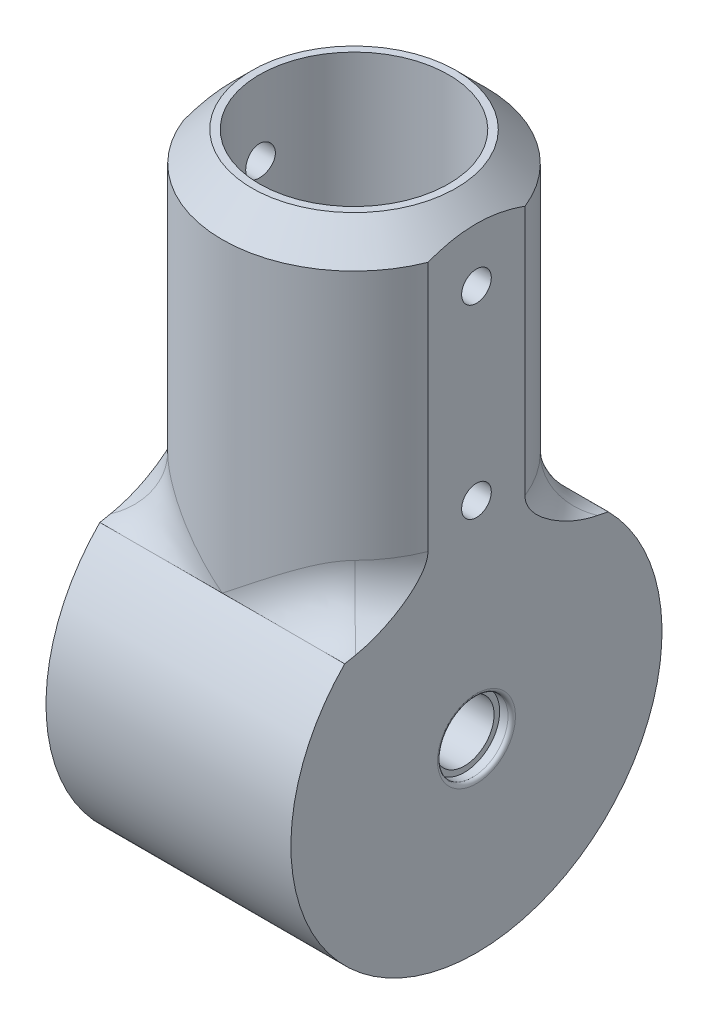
ISO-10303-21;
HEADER;
FILE_DESCRIPTION(('STEP AP214'),'2;1');
FILE_NAME('part.step','',(''),(''),'','','');
FILE_SCHEMA(('AUTOMOTIVE_DESIGN { 1 0 10303 214 1 1 1 1 }'));
ENDSEC;
DATA;
#1=APPLICATION_CONTEXT('core data for automotive mechanical design processes');
#2=APPLICATION_PROTOCOL_DEFINITION('international standard','automotive_design',2000,#1);
#3=PRODUCT_CONTEXT('',#1,'mechanical');
#4=PRODUCT('Part','Part','',(#3));
#5=PRODUCT_RELATED_PRODUCT_CATEGORY('part','',(#4));
#6=PRODUCT_DEFINITION_FORMATION('','',#4);
#7=PRODUCT_DEFINITION_CONTEXT('part definition',#1,'design');
#8=PRODUCT_DEFINITION('design','',#6,#7);
#9=PRODUCT_DEFINITION_SHAPE('','',#8);
#10=(LENGTH_UNIT() NAMED_UNIT(*) SI_UNIT(.MILLI.,.METRE.));
#11=(NAMED_UNIT(*) PLANE_ANGLE_UNIT() SI_UNIT($,.RADIAN.));
#12=(NAMED_UNIT(*) SI_UNIT($,.STERADIAN.) SOLID_ANGLE_UNIT());
#13=UNCERTAINTY_MEASURE_WITH_UNIT(LENGTH_MEASURE(1.E-05),#10,'distance_accuracy_value','');
#14=(GEOMETRIC_REPRESENTATION_CONTEXT(3) GLOBAL_UNCERTAINTY_ASSIGNED_CONTEXT((#13)) GLOBAL_UNIT_ASSIGNED_CONTEXT((#10,
#11,#12)) REPRESENTATION_CONTEXT('',''));
#15=CARTESIAN_POINT('',(0.,0.,0.));
#16=DIRECTION('',(0.,0.,1.));
#17=DIRECTION('',(1.,0.,0.));
#18=AXIS2_PLACEMENT_3D('',#15,#16,#17);
#19=CARTESIAN_POINT('',(-16.501,-17.6050418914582,0.));
#20=DIRECTION('',(1.,0.,0.));
#21=DIRECTION('',(0.,0.,-1.));
#22=AXIS2_PLACEMENT_3D('',#19,#20,#21);
#23=CYLINDRICAL_SURFACE('',#22,3.995);
#24=CARTESIAN_POINT('',(14.88,-17.6050418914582,0.));
#25=DIRECTION('',(1.,0.,0.));
#26=DIRECTION('',(0.,0.,-1.));
#27=AXIS2_PLACEMENT_3D('',#24,#25,#26);
#28=CIRCLE('',#27,3.995);
#29=CARTESIAN_POINT('',(14.88,-17.6050418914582,-3.99500000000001));
#30=VERTEX_POINT('',#29);
#31=EDGE_CURVE('E370',#30,#30,#28,.F.);
#32=ORIENTED_EDGE('',*,*,#31,.F.);
#33=EDGE_LOOP('',(#32));
#34=FACE_BOUND('',#33,.T.);
#35=CARTESIAN_POINT('',(-14.88,-17.6050418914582,0.));
#36=DIRECTION('',(-1.,0.,0.));
#37=DIRECTION('',(0.,0.,1.));
#38=AXIS2_PLACEMENT_3D('',#35,#36,#37);
#39=CIRCLE('',#38,3.995);
#40=CARTESIAN_POINT('',(-14.88,-17.6050418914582,3.99499999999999));
#41=VERTEX_POINT('',#40);
#42=EDGE_CURVE('E373',#41,#41,#39,.F.);
#43=ORIENTED_EDGE('',*,*,#42,.F.);
#44=EDGE_LOOP('',(#43));
#45=FACE_BOUND('',#44,.T.);
#46=ADVANCED_FACE('F47',(#34,#45),#23,.F.);
#47=CARTESIAN_POINT('',(0.,45.25,0.));
#48=DIRECTION('',(0.,1.,0.));
#49=DIRECTION('',(0.,0.,1.));
#50=AXIS2_PLACEMENT_3D('',#47,#48,#49);
#51=PLANE('',#50);
#52=CARTESIAN_POINT('',(0.,45.25,0.));
#53=DIRECTION('',(0.,1.,0.));
#54=DIRECTION('',(0.,0.,1.));
#55=AXIS2_PLACEMENT_3D('',#52,#53,#54);
#56=CIRCLE('',#55,13.75);
#57=CARTESIAN_POINT('',(-12.7816901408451,45.25,5.06861885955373));
#58=VERTEX_POINT('',#57);
#59=EDGE_CURVE('E442',#58,#58,#56,.T.);
#60=ORIENTED_EDGE('',*,*,#59,.T.);
#61=EDGE_LOOP('',(#60));
#62=FACE_BOUND('',#61,.T.);
#63=CARTESIAN_POINT('',(0.,45.25,0.));
#64=DIRECTION('',(0.,1.,0.));
#65=DIRECTION('',(0.,0.,1.));
#66=AXIS2_PLACEMENT_3D('',#63,#64,#65);
#67=CIRCLE('',#66,12.75);
#68=CARTESIAN_POINT('',(0.,45.25,12.75));
#69=VERTEX_POINT('',#68);
#70=EDGE_CURVE('E418',#69,#69,#67,.T.);
#71=ORIENTED_EDGE('',*,*,#70,.F.);
#72=EDGE_LOOP('',(#71));
#73=FACE_BOUND('',#72,.T.);
#74=ADVANCED_FACE('F307',(#62,#73),#51,.T.);
#75=CARTESIAN_POINT('',(0.,45.25,0.));
#76=DIRECTION('',(0.,-1.,0.));
#77=DIRECTION('',(0.,0.,-1.));
#78=AXIS2_PLACEMENT_3D('',#75,#76,#77);
#79=CYLINDRICAL_SURFACE('',#78,17.75);
#80=DIRECTION('',(0.,-1.,0.));
#81=VECTOR('',#80,1.);
#82=CARTESIAN_POINT('',(16.5,45.25,-6.54312616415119));
#83=LINE('',#82,#81);
#84=CARTESIAN_POINT('',(16.5,41.25,-6.54312616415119));
#85=VERTEX_POINT('',#84);
#86=CARTESIAN_POINT('',(16.5,7.5,-6.54312616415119));
#87=VERTEX_POINT('',#86);
#88=EDGE_CURVE('E421',#85,#87,#83,.T.);
#89=ORIENTED_EDGE('',*,*,#88,.T.);
#90=CARTESIAN_POINT('',(0.,7.5,0.));
#91=DIRECTION('',(0.,1.,0.));
#92=DIRECTION('',(0.,0.,1.));
#93=AXIS2_PLACEMENT_3D('',#90,#91,#92);
#94=CIRCLE('',#93,17.75);
#95=CARTESIAN_POINT('',(12.62414093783,7.5,-12.4777227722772));
#96=VERTEX_POINT('',#95);
#97=EDGE_CURVE('E598',#87,#96,#94,.T.);
#98=ORIENTED_EDGE('',*,*,#97,.T.);
#99=CARTESIAN_POINT('',(14.270892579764,6.98337789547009,-10.5548152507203));
#100=CARTESIAN_POINT('',(12.6009704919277,-1.93396099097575,-12.8126736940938));
#101=CARTESIAN_POINT('',(20.3008471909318,0.,-17.75));
#102=CARTESIAN_POINT('',(14.1522866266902,7.07277107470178,-10.7152478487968));
#103=CARTESIAN_POINT('',(12.6414850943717,-1.7915874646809,-12.7051157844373));
#104=CARTESIAN_POINT('',(20.1321260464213,0.,-17.75));
#105=CARTESIAN_POINT('',(14.0293117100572,7.14933473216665,-10.8757967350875));
#106=CARTESIAN_POINT('',(12.6747427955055,-1.63809669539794,-12.6183399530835));
#107=CARTESIAN_POINT('',(19.9571898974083,0.,-17.75));
#108=CARTESIAN_POINT('',(13.7757375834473,7.27854083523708,-11.1952076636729));
#109=CARTESIAN_POINT('',(12.7223046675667,-1.32159438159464,-12.4869696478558));
#110=CARTESIAN_POINT('',(19.5964717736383,0.,-17.75));
#111=CARTESIAN_POINT('',(13.645151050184,7.33122184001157,-11.3540720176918));
#112=CARTESIAN_POINT('',(12.7369752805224,-1.15897904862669,-12.4415755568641));
#113=CARTESIAN_POINT('',(19.4107078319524,0.,-17.75));
#114=CARTESIAN_POINT('',(13.378364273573,7.41427743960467,-11.6672142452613));
#115=CARTESIAN_POINT('',(12.7448687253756,-0.835048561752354,-12.3898255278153));
#116=CARTESIAN_POINT('',(19.0311942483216,0.,-17.75));
#117=CARTESIAN_POINT('',(13.2422299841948,7.44486139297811,-11.8215215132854));
#118=CARTESIAN_POINT('',(12.7387045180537,-0.673896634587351,-12.3823770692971));
#119=CARTESIAN_POINT('',(18.8375384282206,0.,-17.75));
#120=CARTESIAN_POINT('',(12.9639419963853,7.48646244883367,-12.126057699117));
#121=CARTESIAN_POINT('',(12.7046391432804,-0.358337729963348,-12.4001702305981));
#122=CARTESIAN_POINT('',(18.4416639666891,0.,-17.75));
#123=CARTESIAN_POINT('',(12.821785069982,7.49746891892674,-12.2762843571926));
#124=CARTESIAN_POINT('',(12.6771588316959,-0.203868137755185,-12.4247858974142));
#125=CARTESIAN_POINT('',(18.2394407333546,0.,-17.75));
#126=CARTESIAN_POINT('',(12.4741083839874,7.50261242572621,-12.6310364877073));
#127=CARTESIAN_POINT('',(12.585667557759,0.151461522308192,-12.5159323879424));
#128=CARTESIAN_POINT('',(17.7448584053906,0.,-17.75));
#129=CARTESIAN_POINT('',(12.2660577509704,7.48820551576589,-12.8331548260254));
#130=CARTESIAN_POINT('',(12.5119024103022,0.348501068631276,-12.5945924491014));
#131=CARTESIAN_POINT('',(17.4488990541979,0.,-17.75));
#132=CARTESIAN_POINT('',(11.8414778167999,7.42940611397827,-13.2259458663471));
#133=CARTESIAN_POINT('',(12.3248905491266,0.711059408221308,-12.7895740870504));
#134=CARTESIAN_POINT('',(16.8449191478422,0.,-17.75));
#135=CARTESIAN_POINT('',(11.624946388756,7.38500605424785,-13.4166156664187));
#136=CARTESIAN_POINT('',(12.2126232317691,0.877440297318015,-12.9049640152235));
#137=CARTESIAN_POINT('',(16.5368955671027,0.,-17.75));
#138=CARTESIAN_POINT('',(11.1838410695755,7.27025741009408,-13.7864947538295));
#139=CARTESIAN_POINT('',(11.9525849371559,1.17651125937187,-13.1603710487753));
#140=CARTESIAN_POINT('',(15.9094077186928,0.,-17.75));
#141=CARTESIAN_POINT('',(10.9592336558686,7.19978569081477,-13.9656448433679));
#142=CARTESIAN_POINT('',(11.8053971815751,1.31000944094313,-13.3000186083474));
#143=CARTESIAN_POINT('',(15.5898957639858,0.,-17.75));
#144=CARTESIAN_POINT('',(10.5041416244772,7.0367069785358,-14.3110862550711));
#145=CARTESIAN_POINT('',(11.4807157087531,1.54265704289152,-13.592630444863));
#146=CARTESIAN_POINT('',(14.9425113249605,0.,-17.75));
#147=CARTESIAN_POINT('',(10.2736550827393,6.94409265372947,-14.477373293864));
#148=CARTESIAN_POINT('',(11.3037364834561,1.64269752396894,-13.7454455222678));
#149=CARTESIAN_POINT('',(14.6146361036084,0.,-17.75));
#150=CARTESIAN_POINT('',(9.69295596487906,6.68969218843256,-14.8757150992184));
#151=CARTESIAN_POINT('',(10.832965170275,1.85070214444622,-14.1305026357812));
#152=CARTESIAN_POINT('',(13.7885711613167,0.,-17.75));
#153=CARTESIAN_POINT('',(9.33974353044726,6.51631530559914,-15.0997723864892));
#154=CARTESIAN_POINT('',(10.5217406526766,1.94202317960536,-14.3680216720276));
#155=CARTESIAN_POINT('',(13.2861140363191,0.,-17.75));
#156=CARTESIAN_POINT('',(8.62508363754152,6.13651702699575,-15.5190941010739));
#157=CARTESIAN_POINT('',(9.85548510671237,2.06204182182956,-14.8343844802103));
#158=CARTESIAN_POINT('',(12.269485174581,0.,-17.75));
#159=CARTESIAN_POINT('',(8.26363231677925,5.93007984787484,-15.7143446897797));
#160=CARTESIAN_POINT('',(9.50061296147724,2.09258596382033,-15.0641631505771));
#161=CARTESIAN_POINT('',(11.7553079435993,0.,-17.75));
#162=CARTESIAN_POINT('',(7.53419648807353,5.49106859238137,-16.0768271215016));
#163=CARTESIAN_POINT('',(8.75782471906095,2.10235664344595,-15.5034402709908));
#164=CARTESIAN_POINT('',(10.7176597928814,0.,-17.75));
#165=CARTESIAN_POINT('',(7.16620651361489,5.25847168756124,-16.2440341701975));
#166=CARTESIAN_POINT('',(8.36946825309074,2.08274286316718,-15.7140870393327));
#167=CARTESIAN_POINT('',(10.1941810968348,0.,-17.75));
#168=CARTESIAN_POINT('',(6.42556381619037,4.7730339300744,-16.5509925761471));
#169=CARTESIAN_POINT('',(7.56858607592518,2.00256971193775,-16.1079200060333));
#170=CARTESIAN_POINT('',(9.1405907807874,0.,-17.75));
#171=CARTESIAN_POINT('',(6.05291158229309,4.52019518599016,-16.6907467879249));
#172=CARTESIAN_POINT('',(7.15526503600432,1.94268147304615,-16.2922640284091));
#173=CARTESIAN_POINT('',(8.61047985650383,0.,-17.75));
#174=CARTESIAN_POINT('',(5.21323940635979,3.93569679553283,-16.9742645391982));
#175=CARTESIAN_POINT('',(6.21044844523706,1.77307717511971,-16.6695975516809));
#176=CARTESIAN_POINT('',(7.41601662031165,0.,-17.75));
#177=CARTESIAN_POINT('',(4.74522691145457,3.59978008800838,-17.1107986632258));
#178=CARTESIAN_POINT('',(5.67048432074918,1.65484100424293,-16.8565386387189));
#179=CARTESIAN_POINT('',(6.75025236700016,0.,-17.75));
#180=CARTESIAN_POINT('',(3.80548235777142,2.91122230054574,-17.3440322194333));
#181=CARTESIAN_POINT('',(4.57363332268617,1.38441219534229,-17.1776789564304));
#182=CARTESIAN_POINT('',(5.41343264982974,0.,-17.75));
#183=CARTESIAN_POINT('',(3.33374906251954,2.55857544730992,-17.4407177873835));
#184=CARTESIAN_POINT('',(4.01434954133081,1.23204797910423,-17.3133923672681));
#185=CARTESIAN_POINT('',(4.74237542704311,0.,-17.75));
#186=CARTESIAN_POINT('',(1.91688418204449,1.48616887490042,-17.6720694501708));
#187=CARTESIAN_POINT('',(2.33260658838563,0.746159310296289,-17.6360105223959));
#188=CARTESIAN_POINT('',(2.72683524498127,0.,-17.75));
#189=CARTESIAN_POINT('',(0.967335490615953,0.749963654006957,-17.748942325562));
#190=CARTESIAN_POINT('',(1.17177527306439,0.375002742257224,-17.748477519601));
#191=CARTESIAN_POINT('',(1.37606879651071,0.,-17.75));
#192=CARTESIAN_POINT('',(0.0130776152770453,0.0101389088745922,-17.7499963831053));
#193=CARTESIAN_POINT('',(0.0158404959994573,0.00506946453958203,-17.7499949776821));
#194=CARTESIAN_POINT('',(0.0186033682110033,0.,-17.75));
#195=CARTESIAN_POINT('',(0.00653876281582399,0.00506941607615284,-17.749999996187));
#196=CARTESIAN_POINT('',(0.00792019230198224,0.00253471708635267,-17.7500001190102));
#197=CARTESIAN_POINT('',(0.00930162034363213,0.,-17.75));
#198=CARTESIAN_POINT('',(0.,0.,-17.75));
#199=CARTESIAN_POINT('',(0.,0.,-17.75));
#200=CARTESIAN_POINT('',(0.,0.,-17.75));
#201=(BOUNDED_SURFACE() B_SPLINE_SURFACE(3,2,((#99,#100,#101),(#102,#103,#104),(#105,#106,#107),
(#108,#109,#110),(#111,#112,#113),(#114,#115,#116),(#117,#118,#119),(#120,#121,#122),(#123,#124,
#125),(#126,#127,#128),(#129,#130,#131),(#132,#133,#134),(#135,#136,#137),(#138,#139,#140),
(#141,#142,#143),(#144,#145,#146),(#147,#148,#149),(#150,#151,#152),(#153,#154,#155),(#156,#157,
#158),(#159,#160,#161),(#162,#163,#164),(#165,#166,#167),(#168,#169,#170),(#171,#172,#173),
(#174,#175,#176),(#177,#178,#179),(#180,#181,#182),(#183,#184,#185),(#186,#187,#188),(#189,#190,
#191),(#192,#193,#194),(#195,#196,#197),(#198,#199,#200)),.UNSPECIFIED.,.F.,.F.,
.F.) B_SPLINE_SURFACE_WITH_KNOTS((4,2,2,2,2,2,2,2,2,2,2,2,2,2,2,2,4),(3,3),(0.,
0.892050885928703,1.78265635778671,2.66470900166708,3.54724053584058,4.7839918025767,
6.02105524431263,7.26403744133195,8.50743178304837,10.3638837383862,12.2212246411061,
14.0801991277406,15.9389802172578,18.2480274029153,20.5578772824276,25.1639731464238,
25.1957536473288),(0.,1.),
.UNSPECIFIED.) GEOMETRIC_REPRESENTATION_ITEM() RATIONAL_B_SPLINE_SURFACE(((1.,0.625748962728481,
1.),(1.,0.631658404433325,1.),(1.,0.637823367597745,1.),(1.,0.650532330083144,1.),(1.,
0.657075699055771,1.),(1.,0.670365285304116,1.),(1.,0.677108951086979,1.),(1.,0.690752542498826,
1.),(1.,0.697652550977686,1.),(1.,0.714291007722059,1.),(1.,0.724057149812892,1.),(1.,
0.743478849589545,1.),(1.,0.753134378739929,1.),(1.,0.772211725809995,1.),(1.,0.78163220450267,
1.),(1.,0.800067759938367,1.),(1.,0.809082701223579,1.),(1.,0.830936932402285,1.),(1.,
0.843470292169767,1.),(1.,0.867228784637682,1.),(1.,0.878453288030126,1.),(1.,0.899491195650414,
1.),(1.,0.909303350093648,1.),(1.,0.92744492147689,1.),(1.,0.935774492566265,1.),(1.,
0.952760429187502,1.),(1.,0.961007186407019,1.),(1.,0.975152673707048,1.),(1.,0.981050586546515,
1.),(1.,0.995190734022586,1.),(1.,0.999934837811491,1.),(1.,0.999999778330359,1.),(1.,
1.00000000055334,1.),(1.,1.,1.))) REPRESENTATION_ITEM('') SURFACE());
#202=CARTESIAN_POINT('',(14.270892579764,6.98337789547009,-10.5548152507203));
#203=CARTESIAN_POINT('',(14.1522866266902,7.07277107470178,-10.7152478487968));
#204=CARTESIAN_POINT('',(14.0293117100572,7.14933473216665,-10.8757967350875));
#205=CARTESIAN_POINT('',(13.7757375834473,7.27854083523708,-11.1952076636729));
#206=CARTESIAN_POINT('',(13.645151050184,7.33122184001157,-11.3540720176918));
#207=CARTESIAN_POINT('',(13.378364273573,7.41427743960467,-11.6672142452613));
#208=CARTESIAN_POINT('',(13.2422299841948,7.44486139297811,-11.8215215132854));
#209=CARTESIAN_POINT('',(12.9639419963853,7.48646244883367,-12.126057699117));
#210=CARTESIAN_POINT('',(12.821785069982,7.49746891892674,-12.2762843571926));
#211=CARTESIAN_POINT('',(12.4741083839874,7.50261242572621,-12.6310364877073));
#212=CARTESIAN_POINT('',(12.2660577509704,7.48820551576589,-12.8331548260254));
#213=CARTESIAN_POINT('',(11.8414778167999,7.42940611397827,-13.2259458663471));
#214=CARTESIAN_POINT('',(11.624946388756,7.38500605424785,-13.4166156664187));
#215=CARTESIAN_POINT('',(11.1838410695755,7.27025741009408,-13.7864947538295));
#216=CARTESIAN_POINT('',(10.9592336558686,7.19978569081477,-13.9656448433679));
#217=CARTESIAN_POINT('',(10.5041416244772,7.0367069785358,-14.3110862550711));
#218=CARTESIAN_POINT('',(10.2736550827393,6.94409265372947,-14.477373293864));
#219=CARTESIAN_POINT('',(9.69295596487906,6.68969218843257,-14.8757150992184));
#220=CARTESIAN_POINT('',(9.33974353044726,6.51631530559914,-15.0997723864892));
#221=CARTESIAN_POINT('',(8.62508363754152,6.13651702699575,-15.5190941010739));
#222=CARTESIAN_POINT('',(8.26363231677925,5.93007984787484,-15.7143446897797));
#223=CARTESIAN_POINT('',(7.53419648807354,5.49106859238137,-16.0768271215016));
#224=CARTESIAN_POINT('',(7.16620651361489,5.25847168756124,-16.2440341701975));
#225=CARTESIAN_POINT('',(6.42556381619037,4.7730339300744,-16.5509925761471));
#226=CARTESIAN_POINT('',(6.05291158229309,4.52019518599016,-16.6907467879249));
#227=CARTESIAN_POINT('',(5.21323940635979,3.93569679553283,-16.9742645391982));
#228=CARTESIAN_POINT('',(4.74522691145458,3.59978008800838,-17.1107986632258));
#229=CARTESIAN_POINT('',(3.80548235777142,2.91122230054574,-17.3440322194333));
#230=CARTESIAN_POINT('',(3.33374906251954,2.55857544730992,-17.4407177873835));
#231=CARTESIAN_POINT('',(1.9168841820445,1.48616887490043,-17.6720694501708));
#232=CARTESIAN_POINT('',(0.967335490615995,0.749963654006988,-17.7489423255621));
#233=CARTESIAN_POINT('',(0.0130776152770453,0.0101389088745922,-17.7499963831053));
#234=CARTESIAN_POINT('',(0.00653876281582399,0.00506941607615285,-17.749999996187));
#235=CARTESIAN_POINT('',(0.,0.,-17.75));
#236=B_SPLINE_CURVE_WITH_KNOTS('',3,(#202,#203,#204,#205,#206,#207,#208,#209,#210,#211,#212,
#213,#214,#215,#216,#217,#218,#219,#220,#221,#222,#223,#224,#225,#226,#227,#228,#229,#230,#231,
#232,#233,#234,#235),.UNSPECIFIED.,.F.,.F.,(4,2,2,2,2,2,2,2,2,2,2,2,2,2,2,2,4),(0.,
0.892050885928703,1.78265635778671,2.66470900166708,3.54724053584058,4.7839918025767,
6.02105524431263,7.26403744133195,8.50743178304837,10.3638837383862,12.2212246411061,
14.0801991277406,15.9389802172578,18.2480274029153,20.5578772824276,25.1639731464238,
25.1957536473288),.UNSPECIFIED.);
#237=CARTESIAN_POINT('',(0.,0.,-17.75));
#238=VERTEX_POINT('',#237);
#239=EDGE_CURVE('E597',#96,#238,#236,.T.);
#240=ORIENTED_EDGE('',*,*,#239,.T.);
#241=CARTESIAN_POINT('',(-20.3008471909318,0.,-17.75));
#242=CARTESIAN_POINT('',(-12.6009704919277,-1.93396099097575,-12.8126736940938));
#243=CARTESIAN_POINT('',(-14.2708925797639,6.98337789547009,-10.5548152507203));
#244=CARTESIAN_POINT('',(-20.1321260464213,0.,-17.75));
#245=CARTESIAN_POINT('',(-12.6414850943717,-1.7915874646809,-12.7051157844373));
#246=CARTESIAN_POINT('',(-14.1522866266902,7.07277107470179,-10.7152478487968));
#247=CARTESIAN_POINT('',(-19.9571898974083,0.,-17.75));
#248=CARTESIAN_POINT('',(-12.6747427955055,-1.63809669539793,-12.6183399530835));
#249=CARTESIAN_POINT('',(-14.0293117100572,7.14933473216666,-10.8757967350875));
#250=CARTESIAN_POINT('',(-19.5964717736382,0.,-17.75));
#251=CARTESIAN_POINT('',(-12.7223046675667,-1.32159438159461,-12.4869696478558));
#252=CARTESIAN_POINT('',(-13.7757375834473,7.2785408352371,-11.1952076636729));
#253=CARTESIAN_POINT('',(-19.4107078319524,0.,-17.75));
#254=CARTESIAN_POINT('',(-12.7369752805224,-1.15897904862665,-12.4415755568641));
#255=CARTESIAN_POINT('',(-13.645151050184,7.33122184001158,-11.3540720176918));
#256=CARTESIAN_POINT('',(-19.0311942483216,0.,-17.75));
#257=CARTESIAN_POINT('',(-12.7448687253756,-0.835048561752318,-12.3898255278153));
#258=CARTESIAN_POINT('',(-13.3783642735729,7.41427743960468,-11.6672142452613));
#259=CARTESIAN_POINT('',(-18.8375384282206,0.,-17.75));
#260=CARTESIAN_POINT('',(-12.7387045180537,-0.673896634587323,-12.3823770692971));
#261=CARTESIAN_POINT('',(-13.2422299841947,7.44486139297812,-11.8215215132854));
#262=CARTESIAN_POINT('',(-18.4416639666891,0.,-17.75));
#263=CARTESIAN_POINT('',(-12.7046391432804,-0.358337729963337,-12.4001702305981));
#264=CARTESIAN_POINT('',(-12.9639419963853,7.48646244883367,-12.126057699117));
#265=CARTESIAN_POINT('',(-18.2394407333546,0.,-17.75));
#266=CARTESIAN_POINT('',(-12.6771588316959,-0.203868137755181,-12.4247858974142));
#267=CARTESIAN_POINT('',(-12.821785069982,7.49746891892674,-12.2762843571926));
#268=CARTESIAN_POINT('',(-17.7448584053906,0.,-17.75));
#269=CARTESIAN_POINT('',(-12.585667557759,0.151461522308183,-12.5159323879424));
#270=CARTESIAN_POINT('',(-12.4741083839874,7.50261242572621,-12.6310364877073));
#271=CARTESIAN_POINT('',(-17.448899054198,0.,-17.75));
#272=CARTESIAN_POINT('',(-12.5119024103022,0.348501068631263,-12.5945924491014));
#273=CARTESIAN_POINT('',(-12.2660577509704,7.48820551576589,-12.8331548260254));
#274=CARTESIAN_POINT('',(-16.8449191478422,0.,-17.75));
#275=CARTESIAN_POINT('',(-12.3248905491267,0.711059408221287,-12.7895740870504));
#276=CARTESIAN_POINT('',(-11.8414778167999,7.42940611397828,-13.225945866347));
#277=CARTESIAN_POINT('',(-16.5368955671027,0.,-17.75));
#278=CARTESIAN_POINT('',(-12.2126232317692,0.877440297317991,-12.9049640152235));
#279=CARTESIAN_POINT('',(-11.624946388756,7.38500605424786,-13.4166156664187));
#280=CARTESIAN_POINT('',(-15.9094077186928,0.,-17.75));
#281=CARTESIAN_POINT('',(-11.952584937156,1.17651125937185,-13.1603710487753));
#282=CARTESIAN_POINT('',(-11.1838410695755,7.2702574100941,-13.7864947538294));
#283=CARTESIAN_POINT('',(-15.5898957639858,0.,-17.75));
#284=CARTESIAN_POINT('',(-11.8053971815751,1.31000944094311,-13.3000186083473));
#285=CARTESIAN_POINT('',(-10.9592336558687,7.19978569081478,-13.9656448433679));
#286=CARTESIAN_POINT('',(-14.9425113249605,0.,-17.75));
#287=CARTESIAN_POINT('',(-11.4807157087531,1.54265704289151,-13.592630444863));
#288=CARTESIAN_POINT('',(-10.5041416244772,7.03670697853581,-14.3110862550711));
#289=CARTESIAN_POINT('',(-14.6146361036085,0.,-17.75));
#290=CARTESIAN_POINT('',(-11.3037364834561,1.64269752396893,-13.7454455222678));
#291=CARTESIAN_POINT('',(-10.2736550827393,6.94409265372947,-14.477373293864));
#292=CARTESIAN_POINT('',(-13.7885711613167,0.,-17.75));
#293=CARTESIAN_POINT('',(-10.832965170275,1.85070214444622,-14.1305026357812));
#294=CARTESIAN_POINT('',(-9.69295596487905,6.68969218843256,-14.8757150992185));
#295=CARTESIAN_POINT('',(-13.2861140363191,0.,-17.75));
#296=CARTESIAN_POINT('',(-10.5217406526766,1.94202317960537,-14.3680216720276));
#297=CARTESIAN_POINT('',(-9.33974353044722,6.51631530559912,-15.0997723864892));
#298=CARTESIAN_POINT('',(-12.2694851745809,0.,-17.75));
#299=CARTESIAN_POINT('',(-9.8554851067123,2.06204182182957,-14.8343844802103));
#300=CARTESIAN_POINT('',(-8.62508363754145,6.13651702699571,-15.5190941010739));
#301=CARTESIAN_POINT('',(-11.7553079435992,0.,-17.75));
#302=CARTESIAN_POINT('',(-9.50061296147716,2.09258596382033,-15.0641631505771));
#303=CARTESIAN_POINT('',(-8.26363231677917,5.93007984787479,-15.7143446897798));
#304=CARTESIAN_POINT('',(-10.7176597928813,0.,-17.75));
#305=CARTESIAN_POINT('',(-8.75782471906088,2.10235664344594,-15.5034402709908));
#306=CARTESIAN_POINT('',(-7.53419648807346,5.49106859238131,-16.0768271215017));
#307=CARTESIAN_POINT('',(-10.1941810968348,0.,-17.75));
#308=CARTESIAN_POINT('',(-8.36946825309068,2.08274286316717,-15.7140870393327));
#309=CARTESIAN_POINT('',(-7.16620651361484,5.25847168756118,-16.2440341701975));
#310=CARTESIAN_POINT('',(-9.14059078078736,0.,-17.75));
#311=CARTESIAN_POINT('',(-7.56858607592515,2.00256971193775,-16.1079200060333));
#312=CARTESIAN_POINT('',(-6.42556381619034,4.7730339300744,-16.5509925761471));
#313=CARTESIAN_POINT('',(-8.61047985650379,0.,-17.75));
#314=CARTESIAN_POINT('',(-7.15526503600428,1.94268147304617,-16.2922640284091));
#315=CARTESIAN_POINT('',(-6.05291158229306,4.5201951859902,-16.690746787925));
#316=CARTESIAN_POINT('',(-7.4160166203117,0.,-17.75));
#317=CARTESIAN_POINT('',(-6.2104484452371,1.77307717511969,-16.6695975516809));
#318=CARTESIAN_POINT('',(-5.21323940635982,3.93569679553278,-16.9742645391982));
#319=CARTESIAN_POINT('',(-6.75025236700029,0.,-17.75));
#320=CARTESIAN_POINT('',(-5.6704843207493,1.65484100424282,-16.8565386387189));
#321=CARTESIAN_POINT('',(-4.74522691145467,3.59978008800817,-17.1107986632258));
#322=CARTESIAN_POINT('',(-5.41343264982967,0.,-17.75));
#323=CARTESIAN_POINT('',(-4.5736333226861,1.38441219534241,-17.1776789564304));
#324=CARTESIAN_POINT('',(-3.80548235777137,2.91122230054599,-17.3440322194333));
#325=CARTESIAN_POINT('',(-4.74237542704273,0.,-17.75));
#326=CARTESIAN_POINT('',(-4.01434954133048,1.23204797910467,-17.3133923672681));
#327=CARTESIAN_POINT('',(-3.33374906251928,2.5585754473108,-17.4407177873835));
#328=CARTESIAN_POINT('',(-2.72683524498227,0.,-17.75));
#329=CARTESIAN_POINT('',(-2.33260658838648,0.746159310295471,-17.6360105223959));
#330=CARTESIAN_POINT('',(-1.91688418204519,1.4861688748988,-17.6720694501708));
#331=CARTESIAN_POINT('',(-1.37606879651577,0.,-17.75));
#332=CARTESIAN_POINT('',(-1.1717752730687,0.375002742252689,-17.748477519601));
#333=CARTESIAN_POINT('',(-0.96733549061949,0.749963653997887,-17.748942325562));
#334=CARTESIAN_POINT('',(-0.0186033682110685,0.,-17.75));
#335=CARTESIAN_POINT('',(-0.0158404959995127,0.00506946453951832,-17.7499949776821));
#336=CARTESIAN_POINT('',(-0.0130776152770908,0.0101389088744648,-17.7499963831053));
#337=CARTESIAN_POINT('',(-0.00930162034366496,0.,-17.75));
#338=CARTESIAN_POINT('',(-0.00792019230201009,0.00253471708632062,-17.7500001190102));
#339=CARTESIAN_POINT('',(-0.00653876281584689,0.00506941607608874,-17.749999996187));
#340=CARTESIAN_POINT('',(0.,0.,-17.75));
#341=CARTESIAN_POINT('',(0.,0.,-17.75));
#342=CARTESIAN_POINT('',(0.,0.,-17.75));
#343=(BOUNDED_SURFACE() B_SPLINE_SURFACE(3,2,((#241,#242,#243),(#244,#245,#246),(#247,#248,
#249),(#250,#251,#252),(#253,#254,#255),(#256,#257,#258),(#259,#260,#261),(#262,#263,#264),
(#265,#266,#267),(#268,#269,#270),(#271,#272,#273),(#274,#275,#276),(#277,#278,#279),(#280,#281,
#282),(#283,#284,#285),(#286,#287,#288),(#289,#290,#291),(#292,#293,#294),(#295,#296,#297),
(#298,#299,#300),(#301,#302,#303),(#304,#305,#306),(#307,#308,#309),(#310,#311,#312),(#313,#314,
#315),(#316,#317,#318),(#319,#320,#321),(#322,#323,#324),(#325,#326,#327),(#328,#329,#330),
(#331,#332,#333),(#334,#335,#336),(#337,#338,#339),(#340,#341,#342)),.UNSPECIFIED.,.F.,.F.,
.F.) B_SPLINE_SURFACE_WITH_KNOTS((4,2,2,2,2,2,2,2,2,2,2,2,2,2,2,2,4),(3,3),(0.,
0.892050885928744,1.78265635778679,2.66470900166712,3.54724053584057,4.78399180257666,
6.02105524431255,7.2640374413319,8.50743178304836,10.3638837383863,12.2212246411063,
14.0801991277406,15.9389802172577,18.2480274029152,20.5578772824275,25.1639731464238,
25.1957536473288),(0.,1.),
.UNSPECIFIED.) GEOMETRIC_REPRESENTATION_ITEM() RATIONAL_B_SPLINE_SURFACE(((1.,0.625748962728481,
1.),(1.,0.631658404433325,1.),(1.,0.637823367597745,1.),(1.,0.650532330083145,1.),(1.,
0.657075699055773,1.),(1.,0.670365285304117,1.),(1.,0.677108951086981,1.),(1.,0.690752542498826,
1.),(1.,0.697652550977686,1.),(1.,0.714291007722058,1.),(1.,0.724057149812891,1.),(1.,
0.743478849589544,1.),(1.,0.753134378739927,1.),(1.,0.772211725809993,1.),(1.,0.781632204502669,
1.),(1.,0.800067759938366,1.),(1.,0.809082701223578,1.),(1.,0.830936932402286,1.),(1.,
0.843470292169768,1.),(1.,0.867228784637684,1.),(1.,0.878453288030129,1.),(1.,0.899491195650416,
1.),(1.,0.909303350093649,1.),(1.,0.92744492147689,1.),(1.,0.935774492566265,1.),(1.,
0.952760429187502,1.),(1.,0.961007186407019,1.),(1.,0.975152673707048,1.),(1.,0.981050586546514,
1.),(1.,0.995190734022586,1.),(1.,0.999934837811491,1.),(1.,0.999999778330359,1.),(1.,
1.00000000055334,1.),(1.,1.,1.))) REPRESENTATION_ITEM('') SURFACE());
#344=CARTESIAN_POINT('',(-14.2708925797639,6.98337789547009,-10.5548152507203));
#345=CARTESIAN_POINT('',(-14.1522866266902,7.07277107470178,-10.7152478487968));
#346=CARTESIAN_POINT('',(-14.0293117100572,7.14933473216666,-10.8757967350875));
#347=CARTESIAN_POINT('',(-13.7757375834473,7.2785408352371,-11.1952076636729));
#348=CARTESIAN_POINT('',(-13.645151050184,7.33122184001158,-11.3540720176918));
#349=CARTESIAN_POINT('',(-13.3783642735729,7.41427743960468,-11.6672142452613));
#350=CARTESIAN_POINT('',(-13.2422299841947,7.44486139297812,-11.8215215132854));
#351=CARTESIAN_POINT('',(-12.9639419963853,7.48646244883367,-12.126057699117));
#352=CARTESIAN_POINT('',(-12.821785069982,7.49746891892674,-12.2762843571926));
#353=CARTESIAN_POINT('',(-12.4741083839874,7.50261242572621,-12.6310364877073));
#354=CARTESIAN_POINT('',(-12.2660577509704,7.48820551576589,-12.8331548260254));
#355=CARTESIAN_POINT('',(-11.8414778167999,7.42940611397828,-13.225945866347));
#356=CARTESIAN_POINT('',(-11.624946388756,7.38500605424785,-13.4166156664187));
#357=CARTESIAN_POINT('',(-11.1838410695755,7.2702574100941,-13.7864947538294));
#358=CARTESIAN_POINT('',(-10.9592336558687,7.19978569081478,-13.9656448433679));
#359=CARTESIAN_POINT('',(-10.5041416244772,7.03670697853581,-14.3110862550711));
#360=CARTESIAN_POINT('',(-10.2736550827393,6.94409265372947,-14.477373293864));
#361=CARTESIAN_POINT('',(-9.69295596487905,6.68969218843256,-14.8757150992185));
#362=CARTESIAN_POINT('',(-9.33974353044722,6.51631530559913,-15.0997723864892));
#363=CARTESIAN_POINT('',(-8.62508363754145,6.13651702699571,-15.5190941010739));
#364=CARTESIAN_POINT('',(-8.26363231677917,5.93007984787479,-15.7143446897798));
#365=CARTESIAN_POINT('',(-7.53419648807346,5.49106859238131,-16.0768271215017));
#366=CARTESIAN_POINT('',(-7.16620651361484,5.25847168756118,-16.2440341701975));
#367=CARTESIAN_POINT('',(-6.42556381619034,4.7730339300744,-16.5509925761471));
#368=CARTESIAN_POINT('',(-6.05291158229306,4.5201951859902,-16.690746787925));
#369=CARTESIAN_POINT('',(-5.21323940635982,3.93569679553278,-16.9742645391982));
#370=CARTESIAN_POINT('',(-4.74522691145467,3.59978008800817,-17.1107986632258));
#371=CARTESIAN_POINT('',(-3.80548235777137,2.91122230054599,-17.3440322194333));
#372=CARTESIAN_POINT('',(-3.33374906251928,2.5585754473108,-17.4407177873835));
#373=CARTESIAN_POINT('',(-1.91688418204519,1.4861688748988,-17.6720694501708));
#374=CARTESIAN_POINT('',(-0.967335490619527,0.749963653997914,-17.7489423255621));
#375=CARTESIAN_POINT('',(-0.0130776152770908,0.0101389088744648,-17.7499963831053));
#376=CARTESIAN_POINT('',(-0.00653876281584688,0.00506941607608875,-17.749999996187));
#377=CARTESIAN_POINT('',(0.,0.,-17.75));
#378=B_SPLINE_CURVE_WITH_KNOTS('',3,(#344,#345,#346,#347,#348,#349,#350,#351,#352,#353,#354,
#355,#356,#357,#358,#359,#360,#361,#362,#363,#364,#365,#366,#367,#368,#369,#370,#371,#372,#373,
#374,#375,#376,#377),.UNSPECIFIED.,.F.,.F.,(4,2,2,2,2,2,2,2,2,2,2,2,2,2,2,2,4),(0.,
0.892050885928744,1.78265635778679,2.66470900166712,3.54724053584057,4.78399180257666,
6.02105524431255,7.2640374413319,8.50743178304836,10.3638837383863,12.2212246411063,
14.0801991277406,15.9389802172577,18.2480274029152,20.5578772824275,25.1639731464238,
25.1957536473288),.UNSPECIFIED.);
#379=CARTESIAN_POINT('',(-12.62414093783,7.5,-12.4777227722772));
#380=VERTEX_POINT('',#379);
#381=EDGE_CURVE('E594',#238,#380,#378,.F.);
#382=ORIENTED_EDGE('',*,*,#381,.T.);
#383=CARTESIAN_POINT('',(0.,7.5,0.));
#384=DIRECTION('',(0.,1.,0.));
#385=DIRECTION('',(0.,0.,1.));
#386=AXIS2_PLACEMENT_3D('',#383,#384,#385);
#387=CIRCLE('',#386,17.75);
#388=CARTESIAN_POINT('',(-16.5,7.5,-6.54312616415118));
#389=VERTEX_POINT('',#388);
#390=EDGE_CURVE('E591',#380,#389,#387,.T.);
#391=ORIENTED_EDGE('',*,*,#390,.T.);
#392=DIRECTION('',(0.,-1.,0.));
#393=VECTOR('',#392,1.);
#394=CARTESIAN_POINT('',(-16.5,45.25,-6.54312616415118));
#395=LINE('',#394,#393);
#396=CARTESIAN_POINT('',(-16.5,41.25,-6.54312616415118));
#397=VERTEX_POINT('',#396);
#398=EDGE_CURVE('E439',#397,#389,#395,.T.);
#399=ORIENTED_EDGE('',*,*,#398,.F.);
#400=CARTESIAN_POINT('',(0.,41.25,0.));
#401=DIRECTION('',(0.,-1.,0.));
#402=DIRECTION('',(0.,0.,-1.));
#403=AXIS2_PLACEMENT_3D('',#400,#401,#402);
#404=CIRCLE('',#403,17.75);
#405=EDGE_CURVE('E495',#397,#85,#404,.T.);
#406=ORIENTED_EDGE('',*,*,#405,.T.);
#407=EDGE_LOOP('',(#89,#98,#240,#382,#391,#399,#406));
#408=FACE_BOUND('',#407,.T.);
#409=ADVANCED_FACE('F212',(#408),#79,.T.);
#410=CARTESIAN_POINT('',(-16.5,45.25,6.54312616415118));
#411=DIRECTION('',(1.,0.,0.));
#412=DIRECTION('',(0.,0.,-1.));
#413=AXIS2_PLACEMENT_3D('',#410,#411,#412);
#414=PLANE('',#413);
#415=CARTESIAN_POINT('',(-16.5,-17.6050418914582,0.));
#416=DIRECTION('',(1.,0.,0.));
#417=DIRECTION('',(0.,0.,-1.));
#418=AXIS2_PLACEMENT_3D('',#415,#416,#417);
#419=CIRCLE('',#418,5.25);
#420=CARTESIAN_POINT('',(-16.5,-17.6050418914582,-5.25000000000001));
#421=VERTEX_POINT('',#420);
#422=EDGE_CURVE('E284',#421,#421,#419,.T.);
#423=ORIENTED_EDGE('',*,*,#422,.T.);
#424=EDGE_LOOP('',(#423));
#425=FACE_BOUND('',#424,.T.);
#426=CARTESIAN_POINT('',(-16.5,10.2,0.));
#427=DIRECTION('',(1.,0.,0.));
#428=DIRECTION('',(0.,0.,-1.));
#429=AXIS2_PLACEMENT_3D('',#426,#427,#428);
#430=CIRCLE('',#429,2.);
#431=CARTESIAN_POINT('',(-16.5,10.2,-2.));
#432=VERTEX_POINT('',#431);
#433=EDGE_CURVE('E407',#432,#432,#430,.T.);
#434=ORIENTED_EDGE('',*,*,#433,.T.);
#435=EDGE_LOOP('',(#434));
#436=FACE_BOUND('',#435,.T.);
#437=CARTESIAN_POINT('',(-16.5,35.2,0.));
#438=DIRECTION('',(1.,0.,0.));
#439=DIRECTION('',(0.,0.,-1.));
#440=AXIS2_PLACEMENT_3D('',#437,#438,#439);
#441=CIRCLE('',#440,2.);
#442=CARTESIAN_POINT('',(-16.5,35.2,-2.));
#443=VERTEX_POINT('',#442);
#444=EDGE_CURVE('E161',#443,#443,#441,.T.);
#445=ORIENTED_EDGE('',*,*,#444,.T.);
#446=EDGE_LOOP('',(#445));
#447=FACE_BOUND('',#446,.T.);
#448=DIRECTION('',(0.,-1.,0.));
#449=VECTOR('',#448,1.);
#450=CARTESIAN_POINT('',(-16.5,45.25,6.54312616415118));
#451=LINE('',#450,#449);
#452=CARTESIAN_POINT('',(-16.5,41.25,6.54312616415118));
#453=VERTEX_POINT('',#452);
#454=CARTESIAN_POINT('',(-16.5,7.5,6.54312616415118));
#455=VERTEX_POINT('',#454);
#456=EDGE_CURVE('E436',#453,#455,#451,.T.);
#457=ORIENTED_EDGE('',*,*,#456,.F.);
#458=CARTESIAN_POINT('',(-16.5,41.25,6.54312616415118));
#459=CARTESIAN_POINT('',(-16.5,41.3470592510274,6.27980169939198));
#460=CARTESIAN_POINT('',(-16.5,41.4396658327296,6.01486077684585));
#461=CARTESIAN_POINT('',(-16.5,41.6150893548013,5.48166631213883));
#462=CARTESIAN_POINT('',(-16.5,41.6979030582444,5.21341170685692));
#463=CARTESIAN_POINT('',(-16.5,41.9304999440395,4.40289820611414));
#464=CARTESIAN_POINT('',(-16.5,42.0641010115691,3.85578922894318));
#465=CARTESIAN_POINT('',(-16.5,42.2252807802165,3.03495368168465));
#466=CARTESIAN_POINT('',(-16.5,42.272097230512,2.7648904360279));
#467=CARTESIAN_POINT('',(-16.5,42.3530932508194,2.22288566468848));
#468=CARTESIAN_POINT('',(-16.5,42.3872746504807,1.95094441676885));
#469=CARTESIAN_POINT('',(-16.5,42.4424273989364,1.40593899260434));
#470=CARTESIAN_POINT('',(-16.5,42.4634090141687,1.13287585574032));
#471=CARTESIAN_POINT('',(-16.5,42.4918533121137,0.586044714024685));
#472=CARTESIAN_POINT('',(-16.5,42.4993161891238,0.312276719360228));
#473=CARTESIAN_POINT('',(-16.5,42.5005761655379,-0.22764393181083));
#474=CARTESIAN_POINT('',(-16.5,42.4947490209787,-0.493795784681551));
#475=CARTESIAN_POINT('',(-16.5,42.4702941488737,-1.02553721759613));
#476=CARTESIAN_POINT('',(-16.5,42.4516650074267,-1.29112673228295));
#477=CARTESIAN_POINT('',(-16.5,42.4018949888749,-1.82118509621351));
#478=CARTESIAN_POINT('',(-16.5,42.3707515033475,-2.0856537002));
#479=CARTESIAN_POINT('',(-16.5,42.2964347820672,-2.61290673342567));
#480=CARTESIAN_POINT('',(-16.5,42.2532600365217,-2.87569094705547));
#481=CARTESIAN_POINT('',(-16.5,42.1052421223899,-3.66798871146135));
#482=CARTESIAN_POINT('',(-16.5,41.9826045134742,-4.19425327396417));
#483=CARTESIAN_POINT('',(-16.5,41.696625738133,-5.23523430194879));
#484=CARTESIAN_POINT('',(-16.5,41.5332921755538,-5.74995290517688));
#485=CARTESIAN_POINT('',(-16.5,41.1540347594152,-6.81934593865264));
#486=CARTESIAN_POINT('',(-16.5,40.9344360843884,-7.37270691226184));
#487=CARTESIAN_POINT('',(-16.5,40.4618013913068,-8.46507800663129));
#488=CARTESIAN_POINT('',(-16.5,40.208749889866,-9.00408134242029));
#489=CARTESIAN_POINT('',(-16.5,39.6751603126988,-10.0704121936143));
#490=CARTESIAN_POINT('',(-16.5,39.3945348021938,-10.5976956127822));
#491=CARTESIAN_POINT('',(-16.5,38.8119681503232,-11.6401641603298));
#492=CARTESIAN_POINT('',(-16.5,38.5100303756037,-12.1553511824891));
#493=CARTESIAN_POINT('',(-16.5,37.9000321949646,-13.1571577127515));
#494=CARTESIAN_POINT('',(-16.5,37.5925685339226,-13.6441424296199));
#495=CARTESIAN_POINT('',(-16.5,36.9646199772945,-14.6096691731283));
#496=CARTESIAN_POINT('',(-16.5,36.6441340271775,-15.0882105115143));
#497=CARTESIAN_POINT('',(-16.5,35.9951541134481,-16.0340353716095));
#498=CARTESIAN_POINT('',(-16.5,35.6667477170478,-16.5013791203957));
#499=CARTESIAN_POINT('',(-16.5,35.167630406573,-17.1976148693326));
#500=CARTESIAN_POINT('',(-16.5,35.0001960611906,-17.4288663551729));
#501=CARTESIAN_POINT('',(-16.5,34.6633249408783,-17.8898992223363));
#502=CARTESIAN_POINT('',(-16.5,34.4938882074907,-18.1196806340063));
#503=CARTESIAN_POINT('',(-16.5,34.3235370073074,-18.3487826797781));
#504=B_SPLINE_CURVE_WITH_KNOTS('',3,(#458,#459,#460,#461,#462,#463,#464,#465,#466,#467,#468,
#469,#470,#471,#472,#473,#474,#475,#476,#477,#478,#479,#480,#481,#482,#483,#484,#485,#486,#487,
#488,#489,#490,#491,#492,#493,#494,#495,#496,#497,#498,#499,#500,#501,#502,#503),.UNSPECIFIED.,
.F.,.F.,(4,2,2,2,2,2,2,2,2,2,2,2,2,2,2,2,2,2,2,2,2,2,4),(0.,0.841823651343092,1.68392478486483,
3.37100289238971,4.19304149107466,5.01496100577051,5.83624046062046,6.65750811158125,
7.45584441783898,8.25426890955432,9.05285990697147,9.85155116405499,11.4705389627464,
13.0892244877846,14.8738540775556,16.6593125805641,18.4506274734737,20.2416600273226,
21.9691841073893,23.6968483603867,25.4102999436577,26.2667978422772,27.1232780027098),.UNSPECIFIED.);
#505=EDGE_CURVE('E270',#453,#397,#504,.T.);
#506=ORIENTED_EDGE('',*,*,#505,.T.);
#507=ORIENTED_EDGE('',*,*,#398,.T.);
#508=CARTESIAN_POINT('',(-16.5,7.5,-6.54312616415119));
#509=CARTESIAN_POINT('',(-16.5,7.4062413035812,-6.54305389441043));
#510=CARTESIAN_POINT('',(-16.5,7.31252836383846,-6.54789315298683));
#511=CARTESIAN_POINT('',(-16.5,7.1262329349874,-6.5668254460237));
#512=CARTESIAN_POINT('',(-16.5,7.03364848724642,-6.58089905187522));
#513=CARTESIAN_POINT('',(-16.5,6.85183717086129,-6.61741604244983));
#514=CARTESIAN_POINT('',(-16.5,6.76257992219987,-6.6397102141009));
#515=CARTESIAN_POINT('',(-16.5,6.58626700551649,-6.69184004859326));
#516=CARTESIAN_POINT('',(-16.5,6.49921263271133,-6.72168003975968));
#517=CARTESIAN_POINT('',(-16.5,6.29603597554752,-6.80019911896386));
#518=CARTESIAN_POINT('',(-16.5,6.18103019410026,-6.85176777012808));
#519=CARTESIAN_POINT('',(-16.5,5.95613246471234,-6.96498912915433));
#520=CARTESIAN_POINT('',(-16.5,5.84624267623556,-7.02664604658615));
#521=CARTESIAN_POINT('',(-16.5,5.5223644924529,-7.22473421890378));
#522=CARTESIAN_POINT('',(-16.5,5.31594386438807,-7.37353387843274));
#523=CARTESIAN_POINT('',(-16.5,4.91840833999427,-7.69410688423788));
#524=CARTESIAN_POINT('',(-16.5,4.72750224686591,-7.86613007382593));
#525=CARTESIAN_POINT('',(-16.5,4.36035077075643,-8.22539498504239));
#526=CARTESIAN_POINT('',(-16.5,4.18412072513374,-8.41265223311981));
#527=CARTESIAN_POINT('',(-16.5,3.84416302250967,-8.79854600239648));
#528=CARTESIAN_POINT('',(-16.5,3.68045314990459,-8.99719803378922));
#529=CARTESIAN_POINT('',(-16.5,3.36439466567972,-9.40319614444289));
#530=CARTESIAN_POINT('',(-16.5,3.21204232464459,-9.61053933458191));
#531=CARTESIAN_POINT('',(-16.5,2.92390506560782,-10.0236383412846));
#532=CARTESIAN_POINT('',(-16.5,2.78769375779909,-10.2290979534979));
#533=CARTESIAN_POINT('',(-16.5,2.52437099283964,-10.6457980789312));
#534=CARTESIAN_POINT('',(-16.5,2.39726082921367,-10.8570394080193));
#535=CARTESIAN_POINT('',(-16.5,2.15187290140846,-11.2847982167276));
#536=CARTESIAN_POINT('',(-16.5,2.03360176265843,-11.5013194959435));
#537=CARTESIAN_POINT('',(-16.5,1.80598876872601,-11.9390131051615));
#538=CARTESIAN_POINT('',(-16.5,1.69664774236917,-12.1601858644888));
#539=CARTESIAN_POINT('',(-16.5,1.38274748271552,-12.82891691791));
#540=CARTESIAN_POINT('',(-16.5,1.19163255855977,-13.2828739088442));
#541=CARTESIAN_POINT('',(-16.5,0.847893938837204,-14.2047252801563));
#542=CARTESIAN_POINT('',(-16.5,0.695233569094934,-14.6726059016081));
#543=CARTESIAN_POINT('',(-16.5,0.510135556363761,-15.338266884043));
#544=CARTESIAN_POINT('',(-16.5,0.46017723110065,-15.5312729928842));
#545=CARTESIAN_POINT('',(-16.5,0.367483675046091,-15.9188054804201));
#546=CARTESIAN_POINT('',(-16.5,0.324741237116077,-16.1133301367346));
#547=CARTESIAN_POINT('',(-16.5,0.285718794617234,-16.3086285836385));
#548=B_SPLINE_CURVE_WITH_KNOTS('',3,(#508,#509,#510,#511,#512,#513,#514,#515,#516,#517,#518,
#519,#520,#521,#522,#523,#524,#525,#526,#527,#528,#529,#530,#531,#532,#533,#534,#535,#536,#537,
#538,#539,#540,#541,#542,#543,#544,#545,#546,#547),.UNSPECIFIED.,.F.,.F.,(4,2,2,2,2,2,2,2,2,2,2,
2,2,2,2,2,2,2,2,4),(0.,0.281078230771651,0.561566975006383,0.837196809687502,1.11298510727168,
1.49045417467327,1.8680811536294,2.62905234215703,3.3989823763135,4.16970719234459,
4.94150720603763,5.71305266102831,6.45233388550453,7.19171997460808,7.93165483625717,
8.67165829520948,10.1475784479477,11.6220856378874,12.2200720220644,12.8174575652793),.UNSPECIFIED.);
#549=CARTESIAN_POINT('',(-16.5,0.285718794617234,-16.3086285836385));
#550=VERTEX_POINT('',#549);
#551=EDGE_CURVE('E65',#389,#550,#548,.T.);
#552=ORIENTED_EDGE('',*,*,#551,.T.);
#553=CARTESIAN_POINT('',(-16.5,0.285718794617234,-16.3086285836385));
#554=CARTESIAN_POINT('',(-16.5,0.261703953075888,-16.428703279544));
#555=CARTESIAN_POINT('',(-16.5,0.237364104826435,-16.5487119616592));
#556=CARTESIAN_POINT('',(-16.5,0.188618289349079,-16.788713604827));
#557=CARTESIAN_POINT('',(-16.5,0.164212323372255,-16.9087065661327));
#558=CARTESIAN_POINT('',(-16.5,0.115916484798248,-17.1488012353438));
#559=CARTESIAN_POINT('',(-16.5,0.0920266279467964,-17.2689029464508));
#560=CARTESIAN_POINT('',(-16.5,0.0451946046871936,-17.5092925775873));
#561=CARTESIAN_POINT('',(-16.5,0.0222524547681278,-17.629580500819));
#562=CARTESIAN_POINT('',(-16.5,0.,-17.75));
#563=B_SPLINE_CURVE_WITH_KNOTS('',3,(#553,#554,#555,#556,#557,#558,#559,#560,#561,#562),
.UNSPECIFIED.,.F.,.F.,(4,2,2,2,4),(0.,0.367356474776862,0.734706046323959,1.10206680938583,
1.46943396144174),.UNSPECIFIED.);
#564=CARTESIAN_POINT('',(-16.5,0.,-17.75));
#565=VERTEX_POINT('',#564);
#566=EDGE_CURVE('E247',#550,#565,#563,.T.);
#567=ORIENTED_EDGE('',*,*,#566,.T.);
#568=CARTESIAN_POINT('',(-16.5,-17.6050418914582,0.));
#569=DIRECTION('',(1.,0.,0.));
#570=DIRECTION('',(0.,0.,-1.));
#571=AXIS2_PLACEMENT_3D('',#568,#569,#570);
#572=CIRCLE('',#571,25.);
#573=CARTESIAN_POINT('',(-16.5,0.,17.75));
#574=VERTEX_POINT('',#573);
#575=EDGE_CURVE('E150',#574,#565,#572,.T.);
#576=ORIENTED_EDGE('',*,*,#575,.F.);
#577=CARTESIAN_POINT('',(-14.270892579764,6.98337789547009,10.5548152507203));
#578=CARTESIAN_POINT('',(-12.6009704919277,-1.93396099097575,12.8126736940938));
#579=CARTESIAN_POINT('',(-20.3008471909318,0.,17.75));
#580=CARTESIAN_POINT('',(-14.1522866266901,7.07277107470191,10.7152478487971));
#581=CARTESIAN_POINT('',(-12.6414850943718,-1.79158746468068,12.7051157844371));
#582=CARTESIAN_POINT('',(-20.1321260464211,0.,17.75));
#583=CARTESIAN_POINT('',(-14.0293117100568,7.14933473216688,10.875796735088));
#584=CARTESIAN_POINT('',(-12.6747427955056,-1.63809669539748,12.6183399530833));
#585=CARTESIAN_POINT('',(-19.9571898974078,0.,17.75));
#586=CARTESIAN_POINT('',(-13.7757375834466,7.27854083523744,11.1952076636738));
#587=CARTESIAN_POINT('',(-12.7223046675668,-1.32159438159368,12.4869696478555));
#588=CARTESIAN_POINT('',(-19.5964717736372,0.,17.75));
#589=CARTESIAN_POINT('',(-13.645151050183,7.33122184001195,11.354072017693));
#590=CARTESIAN_POINT('',(-12.7369752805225,-1.15897904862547,12.4415755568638));
#591=CARTESIAN_POINT('',(-19.410707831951,0.,17.75));
#592=CARTESIAN_POINT('',(-13.378364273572,7.41427743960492,11.6672142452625));
#593=CARTESIAN_POINT('',(-12.7448687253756,-0.835048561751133,12.3898255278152));
#594=CARTESIAN_POINT('',(-19.0311942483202,0.,17.75));
#595=CARTESIAN_POINT('',(-13.2422299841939,7.44486139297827,11.8215215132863));
#596=CARTESIAN_POINT('',(-12.7387045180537,-0.673896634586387,12.3823770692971));
#597=CARTESIAN_POINT('',(-18.8375384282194,0.,17.75));
#598=CARTESIAN_POINT('',(-12.9639419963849,7.4864624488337,12.1260576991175));
#599=CARTESIAN_POINT('',(-12.7046391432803,-0.358337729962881,12.4001702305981));
#600=CARTESIAN_POINT('',(-18.4416639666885,0.,17.75));
#601=CARTESIAN_POINT('',(-12.8217850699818,7.49746891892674,12.2762843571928));
#602=CARTESIAN_POINT('',(-12.6771588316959,-0.203868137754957,12.4247858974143));
#603=CARTESIAN_POINT('',(-18.2394407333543,0.,17.75));
#604=CARTESIAN_POINT('',(-12.4741083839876,7.50261242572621,12.6310364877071));
#605=CARTESIAN_POINT('',(-12.585667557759,0.151461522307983,12.5159323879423));
#606=CARTESIAN_POINT('',(-17.7448584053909,0.,17.75));
#607=CARTESIAN_POINT('',(-12.2660577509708,7.48820551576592,12.8331548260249));
#608=CARTESIAN_POINT('',(-12.5119024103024,0.348501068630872,12.5945924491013));
#609=CARTESIAN_POINT('',(-17.4488990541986,0.,17.75));
#610=CARTESIAN_POINT('',(-11.8414778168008,7.42940611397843,13.2259458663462));
#611=CARTESIAN_POINT('',(-12.3248905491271,0.711059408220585,12.78957408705));
#612=CARTESIAN_POINT('',(-16.8449191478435,0.,17.75));
#613=CARTESIAN_POINT('',(-11.6249463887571,7.38500605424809,13.4166156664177));
#614=CARTESIAN_POINT('',(-12.2126232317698,0.877440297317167,12.9049640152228));
#615=CARTESIAN_POINT('',(-16.5368955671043,0.,17.75));
#616=CARTESIAN_POINT('',(-11.1838410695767,7.27025741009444,13.7864947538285));
#617=CARTESIAN_POINT('',(-11.9525849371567,1.17651125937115,13.1603710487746));
#618=CARTESIAN_POINT('',(-15.9094077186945,0.,17.75));
#619=CARTESIAN_POINT('',(-10.9592336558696,7.19978569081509,13.9656448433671));
#620=CARTESIAN_POINT('',(-11.8053971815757,1.3100094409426,13.3000186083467));
#621=CARTESIAN_POINT('',(-15.5898957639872,0.,17.75));
#622=CARTESIAN_POINT('',(-10.5041416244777,7.036706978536,14.3110862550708));
#623=CARTESIAN_POINT('',(-11.4807157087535,1.5426570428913,13.5926304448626));
#624=CARTESIAN_POINT('',(-14.9425113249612,0.,17.75));
#625=CARTESIAN_POINT('',(-10.2736550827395,6.94409265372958,14.4773732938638));
#626=CARTESIAN_POINT('',(-11.3037364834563,1.64269752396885,13.7454455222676));
#627=CARTESIAN_POINT('',(-14.6146361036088,0.,17.75));
#628=CARTESIAN_POINT('',(-9.69295596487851,6.68969218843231,14.8757150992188));
#629=CARTESIAN_POINT('',(-10.8329651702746,1.85070214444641,14.1305026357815));
#630=CARTESIAN_POINT('',(-13.7885711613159,0.,17.75));
#631=CARTESIAN_POINT('',(-9.33974353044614,6.51631530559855,15.0997723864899));
#632=CARTESIAN_POINT('',(-10.5217406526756,1.94202317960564,14.3680216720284));
#633=CARTESIAN_POINT('',(-13.2861140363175,0.,17.75));
#634=CARTESIAN_POINT('',(-8.6250836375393,6.13651702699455,15.5190941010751));
#635=CARTESIAN_POINT('',(-9.85548510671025,2.06204182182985,14.8343844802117));
#636=CARTESIAN_POINT('',(-12.2694851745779,0.,17.75));
#637=CARTESIAN_POINT('',(-8.26363231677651,5.93007984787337,15.7143446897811));
#638=CARTESIAN_POINT('',(-9.50061296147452,2.09258596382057,15.0641631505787));
#639=CARTESIAN_POINT('',(-11.7553079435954,0.,17.75));
#640=CARTESIAN_POINT('',(-7.534196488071,5.49106859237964,16.0768271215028));
#641=CARTESIAN_POINT('',(-8.75782471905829,2.10235664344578,15.5034402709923));
#642=CARTESIAN_POINT('',(-10.7176597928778,0.,17.75));
#643=CARTESIAN_POINT('',(-7.1662065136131,5.25847168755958,16.2440341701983));
#644=CARTESIAN_POINT('',(-8.36946825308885,2.0827428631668,15.7140870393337));
#645=CARTESIAN_POINT('',(-10.1941810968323,0.,17.75));
#646=CARTESIAN_POINT('',(-6.42556381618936,4.7730339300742,16.5509925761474));
#647=CARTESIAN_POINT('',(-7.56858607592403,2.00256971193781,16.1079200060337));
#648=CARTESIAN_POINT('',(-9.14059078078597,0.,17.75));
#649=CARTESIAN_POINT('',(-6.05291158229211,4.52019518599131,16.6907467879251));
#650=CARTESIAN_POINT('',(-7.15526503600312,1.94268147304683,16.2922640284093));
#651=CARTESIAN_POINT('',(-8.61047985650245,0.,17.75));
#652=CARTESIAN_POINT('',(-5.21323940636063,3.9356967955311,16.9742645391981));
#653=CARTESIAN_POINT('',(-6.21044844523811,1.77307717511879,16.6695975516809));
#654=CARTESIAN_POINT('',(-7.41601662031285,0.,17.75));
#655=CARTESIAN_POINT('',(-4.74522691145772,3.59978008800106,17.1107986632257));
#656=CARTESIAN_POINT('',(-5.6704843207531,1.65484100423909,16.8565386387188));
#657=CARTESIAN_POINT('',(-6.75025236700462,0.,17.75));
#658=CARTESIAN_POINT('',(-3.80548235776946,2.91122230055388,17.3440322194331));
#659=CARTESIAN_POINT('',(-4.57363332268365,1.38441219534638,17.1776789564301));
#660=CARTESIAN_POINT('',(-5.41343264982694,0.,17.75));
#661=CARTESIAN_POINT('',(-3.33374906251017,2.55857544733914,17.4407177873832));
#662=CARTESIAN_POINT('',(-4.01434954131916,1.23204797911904,17.3133923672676));
#663=CARTESIAN_POINT('',(-4.74237542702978,0.,17.75));
#664=CARTESIAN_POINT('',(-1.91688418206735,1.48616887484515,17.6720694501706));
#665=CARTESIAN_POINT('',(-2.33260658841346,0.746159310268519,17.6360105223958));
#666=CARTESIAN_POINT('',(-2.72683524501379,0.,17.75));
#667=CARTESIAN_POINT('',(-0.967335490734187,0.749963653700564,17.7489423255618));
#668=CARTESIAN_POINT('',(-1.17177527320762,0.37500274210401,17.7484775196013));
#669=CARTESIAN_POINT('',(-1.37606879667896,0.,17.75));
#670=CARTESIAN_POINT('',(-0.0130776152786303,0.0101389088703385,17.7499963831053));
#671=CARTESIAN_POINT('',(-0.0158404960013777,0.00506946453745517,17.749994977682));
#672=CARTESIAN_POINT('',(-0.0186033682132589,0.,17.75));
#673=CARTESIAN_POINT('',(-0.00653876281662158,0.00506941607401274,17.749999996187));
#674=CARTESIAN_POINT('',(-0.00792019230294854,0.00253471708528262,17.7500001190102));
#675=CARTESIAN_POINT('',(-0.00930162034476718,0.,17.75));
#676=CARTESIAN_POINT('',(0.,0.,17.75));
#677=CARTESIAN_POINT('',(0.,0.,17.75));
#678=CARTESIAN_POINT('',(0.,0.,17.75));
#679=(BOUNDED_SURFACE() B_SPLINE_SURFACE(3,2,((#577,#578,#579),(#580,#581,#582),(#583,#584,
#585),(#586,#587,#588),(#589,#590,#591),(#592,#593,#594),(#595,#596,#597),(#598,#599,#600),
(#601,#602,#603),(#604,#605,#606),(#607,#608,#609),(#610,#611,#612),(#613,#614,#615),(#616,#617,
#618),(#619,#620,#621),(#622,#623,#624),(#625,#626,#627),(#628,#629,#630),(#631,#632,#633),
(#634,#635,#636),(#637,#638,#639),(#640,#641,#642),(#643,#644,#645),(#646,#647,#648),(#649,#650,
#651),(#652,#653,#654),(#655,#656,#657),(#658,#659,#660),(#661,#662,#663),(#664,#665,#666),
(#667,#668,#669),(#670,#671,#672),(#673,#674,#675),(#676,#677,#678)),.UNSPECIFIED.,.F.,.F.,
.F.) B_SPLINE_SURFACE_WITH_KNOTS((4,2,2,2,2,2,2,2,2,2,2,2,2,2,2,2,4),(3,3),(0.,
0.892050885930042,1.78265635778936,2.6647090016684,3.54724053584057,4.78399180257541,
6.02105524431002,7.26403744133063,8.50743178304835,10.3638837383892,12.2212246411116,
14.0801991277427,15.9389802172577,18.2480274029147,20.5578772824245,25.1639731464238,
25.1957536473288),(0.,1.),
.UNSPECIFIED.) GEOMETRIC_REPRESENTATION_ITEM() RATIONAL_B_SPLINE_SURFACE(((1.,0.625748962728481,
1.),(1.,0.631658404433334,1.),(1.,0.637823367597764,1.),(1.,0.650532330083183,1.),(1.,
0.657075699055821,1.),(1.,0.670365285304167,1.),(1.,0.67710895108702,1.),(1.,0.690752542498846,
1.),(1.,0.697652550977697,1.),(1.,0.714291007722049,1.),(1.,0.724057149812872,1.),(1.,
0.743478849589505,1.),(1.,0.753134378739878,1.),(1.,0.772211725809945,1.),(1.,0.781632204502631,
1.),(1.,0.800067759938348,1.),(1.,0.809082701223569,1.),(1.,0.830936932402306,1.),(1.,
0.843470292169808,1.),(1.,0.867228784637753,1.),(1.,0.878453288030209,1.),(1.,0.899491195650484,
1.),(1.,0.909303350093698,1.),(1.,0.927444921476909,1.),(1.,0.935774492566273,1.),(1.,
0.952760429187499,1.),(1.,0.961007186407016,1.),(1.,0.975152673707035,1.),(1.,0.981050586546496,
1.),(1.,0.995190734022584,1.),(1.,0.999934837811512,1.),(1.,0.999999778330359,1.),(1.,
1.00000000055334,1.),(1.,1.,1.))) REPRESENTATION_ITEM('') SURFACE());
#680=CARTESIAN_POINT('',(-16.5,0.,17.75));
#681=CARTESIAN_POINT('',(-16.5,0.0222524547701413,17.6295805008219));
#682=CARTESIAN_POINT('',(-16.5,0.045194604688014,17.5092925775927));
#683=CARTESIAN_POINT('',(-16.5,0.0920266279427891,17.2689029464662));
#684=CARTESIAN_POINT('',(-16.5,0.115916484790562,17.1488012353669));
#685=CARTESIAN_POINT('',(-16.5,0.164212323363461,16.9087065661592));
#686=CARTESIAN_POINT('',(-16.5,0.188618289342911,16.7887136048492));
#687=CARTESIAN_POINT('',(-16.5,0.237364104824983,16.5487119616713));
#688=CARTESIAN_POINT('',(-16.5,0.261703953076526,16.4287032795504));
#689=CARTESIAN_POINT('',(-16.5,0.285718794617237,16.3086285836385));
#690=B_SPLINE_CURVE_WITH_KNOTS('',3,(#680,#681,#682,#683,#684,#685,#686,#687,#688,#689),
.UNSPECIFIED.,.F.,.F.,(4,2,2,2,4),(0.,0.367367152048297,0.734727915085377,1.10207748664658,
1.46943396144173),.UNSPECIFIED.);
#691=CARTESIAN_POINT('',(-16.5,0.285718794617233,16.3086285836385));
#692=VERTEX_POINT('',#691);
#693=EDGE_CURVE('E71',#574,#692,#690,.T.);
#694=ORIENTED_EDGE('',*,*,#693,.T.);
#695=CARTESIAN_POINT('',(-16.5,0.285718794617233,16.3086285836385));
#696=CARTESIAN_POINT('',(-16.5,0.332665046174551,16.0736882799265));
#697=CARTESIAN_POINT('',(-16.5,0.384995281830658,15.839846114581));
#698=CARTESIAN_POINT('',(-16.5,0.499928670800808,15.3747345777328));
#699=CARTESIAN_POINT('',(-16.5,0.562530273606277,15.143464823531));
#700=CARTESIAN_POINT('',(-16.5,0.697534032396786,14.6837755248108));
#701=CARTESIAN_POINT('',(-16.5,0.769937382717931,14.4553563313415));
#702=CARTESIAN_POINT('',(-16.5,0.924114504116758,14.0017173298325));
#703=CARTESIAN_POINT('',(-16.5,1.00588863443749,13.7764976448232));
#704=CARTESIAN_POINT('',(-16.5,1.26506945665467,13.1051085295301));
#705=CARTESIAN_POINT('',(-16.5,1.45607815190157,12.6640747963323));
#706=CARTESIAN_POINT('',(-16.5,1.76807694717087,12.015061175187));
#707=CARTESIAN_POINT('',(-16.5,1.87631925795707,11.8008212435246));
#708=CARTESIAN_POINT('',(-16.5,2.1012505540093,11.3768208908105));
#709=CARTESIAN_POINT('',(-16.5,2.21793877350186,11.1670600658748));
#710=CARTESIAN_POINT('',(-16.5,2.46388529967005,10.7454670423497));
#711=CARTESIAN_POINT('',(-16.5,2.59343537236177,10.533805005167));
#712=CARTESIAN_POINT('',(-16.5,2.86182527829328,10.1164662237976));
#713=CARTESIAN_POINT('',(-16.5,3.00066426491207,9.91078893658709));
#714=CARTESIAN_POINT('',(-16.5,3.28820291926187,9.50630540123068));
#715=CARTESIAN_POINT('',(-16.5,3.43690647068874,9.30750190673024));
#716=CARTESIAN_POINT('',(-16.5,3.7449734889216,8.91833235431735));
#717=CARTESIAN_POINT('',(-16.5,3.90433470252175,8.72796452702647));
#718=CARTESIAN_POINT('',(-16.5,4.18585668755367,8.41306337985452));
#719=CARTESIAN_POINT('',(-16.5,4.30496645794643,8.28580429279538));
#720=CARTESIAN_POINT('',(-16.5,4.54978564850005,8.03781999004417));
#721=CARTESIAN_POINT('',(-16.5,4.675493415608,7.91709315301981));
#722=CARTESIAN_POINT('',(-16.5,4.93423290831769,7.68398174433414));
#723=CARTESIAN_POINT('',(-16.5,5.06725650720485,7.57158822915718));
#724=CARTESIAN_POINT('',(-16.5,5.3416343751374,7.35757740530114));
#725=CARTESIAN_POINT('',(-16.5,5.4829825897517,7.25595241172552));
#726=CARTESIAN_POINT('',(-16.5,5.79398987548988,7.05471106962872));
#727=CARTESIAN_POINT('',(-16.5,5.96494579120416,6.95705558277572));
#728=CARTESIAN_POINT('',(-16.5,6.31871835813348,6.78774200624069));
#729=CARTESIAN_POINT('',(-16.5,6.50147312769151,6.71595950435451));
#730=CARTESIAN_POINT('',(-16.5,6.82030965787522,6.62337092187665));
#731=CARTESIAN_POINT('',(-16.5,6.95377837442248,6.59371202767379));
#732=CARTESIAN_POINT('',(-16.5,7.15667782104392,6.56358992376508));
#733=CARTESIAN_POINT('',(-16.5,7.22507935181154,6.55594208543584));
#734=CARTESIAN_POINT('',(-16.5,7.36231231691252,6.5456999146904));
#735=CARTESIAN_POINT('',(-16.5,7.43114404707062,6.54310956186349));
#736=CARTESIAN_POINT('',(-16.5,7.5,6.54312616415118));
#737=B_SPLINE_CURVE_WITH_KNOTS('',3,(#695,#696,#697,#698,#699,#700,#701,#702,#703,#704,#705,
#706,#707,#708,#709,#710,#711,#712,#713,#714,#715,#716,#717,#718,#719,#720,#721,#722,#723,#724,
#725,#726,#727,#728,#729,#730,#731,#732,#733,#734,#735,#736),.UNSPECIFIED.,.F.,.F.,(4,2,2,2,2,2,
2,2,2,2,2,2,2,2,2,2,2,2,2,2,4),(0.,0.718658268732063,1.43720815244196,2.15584566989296,
2.87451074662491,4.31454212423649,5.03449934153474,5.75439136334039,6.49864749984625,
7.24283589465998,7.98731903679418,8.73164527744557,9.25435799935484,9.77694038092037,
10.2989535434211,10.8205916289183,11.4097167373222,11.9959699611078,12.4048043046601,
12.6111166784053,12.8175913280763),.UNSPECIFIED.);
#738=EDGE_CURVE('E241',#692,#455,#737,.T.);
#739=ORIENTED_EDGE('',*,*,#738,.T.);
#740=EDGE_LOOP('',(#457,#506,#507,#552,#567,#576,#694,#739));
#741=FACE_BOUND('',#740,.T.);
#742=ADVANCED_FACE('F258',(#425,#436,#447,#741),#414,.F.);
#743=CARTESIAN_POINT('',(0.,45.25,0.));
#744=DIRECTION('',(0.,-1.,0.));
#745=DIRECTION('',(0.,0.,-1.));
#746=AXIS2_PLACEMENT_3D('',#743,#744,#745);
#747=CYLINDRICAL_SURFACE('',#746,17.75);
#748=CARTESIAN_POINT('',(20.3008471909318,0.,17.75));
#749=CARTESIAN_POINT('',(12.6009704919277,-1.93396099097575,12.8126736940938));
#750=CARTESIAN_POINT('',(14.270892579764,6.98337789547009,10.5548152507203));
#751=CARTESIAN_POINT('',(20.1321260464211,0.,17.75));
#752=CARTESIAN_POINT('',(12.6414850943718,-1.79158746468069,12.7051157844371));
#753=CARTESIAN_POINT('',(14.1522866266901,7.07277107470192,10.7152478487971));
#754=CARTESIAN_POINT('',(19.9571898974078,0.,17.75));
#755=CARTESIAN_POINT('',(12.6747427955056,-1.63809669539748,12.6183399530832));
#756=CARTESIAN_POINT('',(14.0293117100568,7.14933473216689,10.875796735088));
#757=CARTESIAN_POINT('',(19.5964717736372,0.,17.75));
#758=CARTESIAN_POINT('',(12.7223046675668,-1.32159438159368,12.4869696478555));
#759=CARTESIAN_POINT('',(13.7757375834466,7.27854083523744,11.1952076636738));
#760=CARTESIAN_POINT('',(19.410707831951,0.,17.75));
#761=CARTESIAN_POINT('',(12.7369752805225,-1.15897904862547,12.4415755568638));
#762=CARTESIAN_POINT('',(13.645151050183,7.33122184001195,11.354072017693));
#763=CARTESIAN_POINT('',(19.0311942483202,0.,17.75));
#764=CARTESIAN_POINT('',(12.7448687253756,-0.835048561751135,12.3898255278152));
#765=CARTESIAN_POINT('',(13.378364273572,7.41427743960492,11.6672142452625));
#766=CARTESIAN_POINT('',(18.8375384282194,0.,17.75));
#767=CARTESIAN_POINT('',(12.7387045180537,-0.673896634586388,12.3823770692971));
#768=CARTESIAN_POINT('',(13.2422299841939,7.44486139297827,11.8215215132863));
#769=CARTESIAN_POINT('',(18.4416639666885,0.,17.75));
#770=CARTESIAN_POINT('',(12.7046391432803,-0.358337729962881,12.4001702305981));
#771=CARTESIAN_POINT('',(12.9639419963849,7.4864624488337,12.1260576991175));
#772=CARTESIAN_POINT('',(18.2394407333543,0.,17.75));
#773=CARTESIAN_POINT('',(12.6771588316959,-0.203868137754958,12.4247858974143));
#774=CARTESIAN_POINT('',(12.8217850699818,7.49746891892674,12.2762843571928));
#775=CARTESIAN_POINT('',(17.7448584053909,0.,17.75));
#776=CARTESIAN_POINT('',(12.585667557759,0.151461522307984,12.5159323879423));
#777=CARTESIAN_POINT('',(12.4741083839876,7.50261242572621,12.6310364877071));
#778=CARTESIAN_POINT('',(17.4488990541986,0.,17.75));
#779=CARTESIAN_POINT('',(12.5119024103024,0.348501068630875,12.5945924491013));
#780=CARTESIAN_POINT('',(12.2660577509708,7.48820551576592,12.833154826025));
#781=CARTESIAN_POINT('',(16.8449191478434,0.,17.75));
#782=CARTESIAN_POINT('',(12.3248905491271,0.711059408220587,12.78957408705));
#783=CARTESIAN_POINT('',(11.8414778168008,7.42940611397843,13.2259458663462));
#784=CARTESIAN_POINT('',(16.5368955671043,0.,17.75));
#785=CARTESIAN_POINT('',(12.2126232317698,0.877440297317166,12.9049640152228));
#786=CARTESIAN_POINT('',(11.6249463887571,7.38500605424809,13.4166156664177));
#787=CARTESIAN_POINT('',(15.9094077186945,0.,17.75));
#788=CARTESIAN_POINT('',(11.9525849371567,1.17651125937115,13.1603710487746));
#789=CARTESIAN_POINT('',(11.1838410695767,7.27025741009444,13.7864947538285));
#790=CARTESIAN_POINT('',(15.5898957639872,0.,17.75));
#791=CARTESIAN_POINT('',(11.8053971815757,1.3100094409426,13.3000186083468));
#792=CARTESIAN_POINT('',(10.9592336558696,7.19978569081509,13.9656448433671));
#793=CARTESIAN_POINT('',(14.9425113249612,0.,17.75));
#794=CARTESIAN_POINT('',(11.4807157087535,1.5426570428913,13.5926304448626));
#795=CARTESIAN_POINT('',(10.5041416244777,7.036706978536,14.3110862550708));
#796=CARTESIAN_POINT('',(14.6146361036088,0.,17.75));
#797=CARTESIAN_POINT('',(11.3037364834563,1.64269752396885,13.7454455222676));
#798=CARTESIAN_POINT('',(10.2736550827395,6.94409265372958,14.4773732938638));
#799=CARTESIAN_POINT('',(13.7885711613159,0.,17.75));
#800=CARTESIAN_POINT('',(10.8329651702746,1.85070214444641,14.1305026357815));
#801=CARTESIAN_POINT('',(9.69295596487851,6.68969218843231,14.8757150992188));
#802=CARTESIAN_POINT('',(13.2861140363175,0.,17.75));
#803=CARTESIAN_POINT('',(10.5217406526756,1.94202317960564,14.3680216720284));
#804=CARTESIAN_POINT('',(9.33974353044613,6.51631530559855,15.0997723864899));
#805=CARTESIAN_POINT('',(12.2694851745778,0.,17.75));
#806=CARTESIAN_POINT('',(9.85548510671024,2.06204182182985,14.8343844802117));
#807=CARTESIAN_POINT('',(8.62508363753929,6.13651702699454,15.5190941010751));
#808=CARTESIAN_POINT('',(11.7553079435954,0.,17.75));
#809=CARTESIAN_POINT('',(9.50061296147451,2.09258596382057,15.0641631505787));
#810=CARTESIAN_POINT('',(8.2636323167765,5.93007984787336,15.7143446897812));
#811=CARTESIAN_POINT('',(10.7176597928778,0.,17.75));
#812=CARTESIAN_POINT('',(8.75782471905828,2.10235664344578,15.5034402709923));
#813=CARTESIAN_POINT('',(7.53419648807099,5.49106859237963,16.0768271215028));
#814=CARTESIAN_POINT('',(10.1941810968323,0.,17.75));
#815=CARTESIAN_POINT('',(8.36946825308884,2.0827428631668,15.7140870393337));
#816=CARTESIAN_POINT('',(7.1662065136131,5.25847168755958,16.2440341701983));
#817=CARTESIAN_POINT('',(9.14059078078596,0.,17.75));
#818=CARTESIAN_POINT('',(7.56858607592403,2.00256971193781,16.1079200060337));
#819=CARTESIAN_POINT('',(6.42556381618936,4.7730339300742,16.5509925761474));
#820=CARTESIAN_POINT('',(8.61047985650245,0.,17.75));
#821=CARTESIAN_POINT('',(7.15526503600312,1.94268147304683,16.2922640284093));
#822=CARTESIAN_POINT('',(6.05291158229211,4.52019518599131,16.6907467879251));
#823=CARTESIAN_POINT('',(7.41601662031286,0.,17.75));
#824=CARTESIAN_POINT('',(6.21044844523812,1.77307717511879,16.6695975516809));
#825=CARTESIAN_POINT('',(5.21323940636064,3.9356967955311,16.9742645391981));
#826=CARTESIAN_POINT('',(6.75025236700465,0.,17.75));
#827=CARTESIAN_POINT('',(5.67048432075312,1.65484100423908,16.8565386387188));
#828=CARTESIAN_POINT('',(4.74522691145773,3.59978008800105,17.1107986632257));
#829=CARTESIAN_POINT('',(5.41343264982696,0.,17.75));
#830=CARTESIAN_POINT('',(4.57363332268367,1.3844121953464,17.1776789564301));
#831=CARTESIAN_POINT('',(3.80548235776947,2.91122230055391,17.3440322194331));
#832=CARTESIAN_POINT('',(4.74237542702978,0.,17.75));
#833=CARTESIAN_POINT('',(4.01434954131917,1.23204797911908,17.3133923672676));
#834=CARTESIAN_POINT('',(3.33374906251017,2.55857544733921,17.4407177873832));
#835=CARTESIAN_POINT('',(2.72683524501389,0.,17.75));
#836=CARTESIAN_POINT('',(2.33260658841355,0.746159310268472,17.6360105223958));
#837=CARTESIAN_POINT('',(1.91688418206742,1.48616887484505,17.6720694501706));
#838=CARTESIAN_POINT('',(1.37606879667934,0.,17.75));
#839=CARTESIAN_POINT('',(1.17177527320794,0.375002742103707,17.7484775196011));
#840=CARTESIAN_POINT('',(0.967335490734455,0.749963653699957,17.7489423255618));
#841=CARTESIAN_POINT('',(0.0186033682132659,0.,17.75));
#842=CARTESIAN_POINT('',(0.0158404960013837,0.0050694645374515,17.749994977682));
#843=CARTESIAN_POINT('',(0.0130776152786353,0.0101389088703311,17.7499963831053));
#844=CARTESIAN_POINT('',(0.00930162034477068,0.,17.75));
#845=CARTESIAN_POINT('',(0.00792019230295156,0.00253471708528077,17.7500001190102));
#846=CARTESIAN_POINT('',(0.00653876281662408,0.00506941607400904,17.749999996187));
#847=CARTESIAN_POINT('',(0.,0.,17.75));
#848=CARTESIAN_POINT('',(0.,0.,17.75));
#849=CARTESIAN_POINT('',(0.,0.,17.75));
#850=(BOUNDED_SURFACE() B_SPLINE_SURFACE(3,2,((#748,#749,#750),(#751,#752,#753),(#754,#755,
#756),(#757,#758,#759),(#760,#761,#762),(#763,#764,#765),(#766,#767,#768),(#769,#770,#771),
(#772,#773,#774),(#775,#776,#777),(#778,#779,#780),(#781,#782,#783),(#784,#785,#786),(#787,#788,
#789),(#790,#791,#792),(#793,#794,#795),(#796,#797,#798),(#799,#800,#801),(#802,#803,#804),
(#805,#806,#807),(#808,#809,#810),(#811,#812,#813),(#814,#815,#816),(#817,#818,#819),(#820,#821,
#822),(#823,#824,#825),(#826,#827,#828),(#829,#830,#831),(#832,#833,#834),(#835,#836,#837),
(#838,#839,#840),(#841,#842,#843),(#844,#845,#846),(#847,#848,#849)),.UNSPECIFIED.,.F.,.F.,
.F.) B_SPLINE_SURFACE_WITH_KNOTS((4,2,2,2,2,2,2,2,2,2,2,2,2,2,2,2,4),(3,3),(0.,
0.892050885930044,1.78265635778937,2.6647090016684,3.54724053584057,4.78399180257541,
6.02105524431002,7.26403744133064,8.50743178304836,10.3638837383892,12.2212246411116,
14.0801991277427,15.9389802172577,18.2480274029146,20.5578772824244,25.1639731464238,
25.1957536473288),(0.,1.),
.UNSPECIFIED.) GEOMETRIC_REPRESENTATION_ITEM() RATIONAL_B_SPLINE_SURFACE(((1.,0.625748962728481,
1.),(1.,0.631658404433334,1.),(1.,0.637823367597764,1.),(1.,0.650532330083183,1.),(1.,
0.657075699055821,1.),(1.,0.670365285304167,1.),(1.,0.67710895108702,1.),(1.,0.690752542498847,
1.),(1.,0.697652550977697,1.),(1.,0.714291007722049,1.),(1.,0.724057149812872,1.),(1.,
0.743478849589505,1.),(1.,0.753134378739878,1.),(1.,0.772211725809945,1.),(1.,0.781632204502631,
1.),(1.,0.800067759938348,1.),(1.,0.809082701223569,1.),(1.,0.830936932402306,1.),(1.,
0.843470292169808,1.),(1.,0.867228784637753,1.),(1.,0.87845328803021,1.),(1.,0.899491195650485,
1.),(1.,0.909303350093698,1.),(1.,0.927444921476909,1.),(1.,0.935774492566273,1.),(1.,
0.952760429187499,1.),(1.,0.961007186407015,1.),(1.,0.975152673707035,1.),(1.,0.981050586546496,
1.),(1.,0.995190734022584,1.),(1.,0.999934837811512,1.),(1.,0.999999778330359,1.),(1.,
1.00000000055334,1.),(1.,1.,1.))) REPRESENTATION_ITEM('') SURFACE());
#851=CARTESIAN_POINT('',(14.270892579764,6.98337789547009,10.5548152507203));
#852=CARTESIAN_POINT('',(14.1522866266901,7.07277107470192,10.7152478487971));
#853=CARTESIAN_POINT('',(14.0293117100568,7.14933473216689,10.875796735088));
#854=CARTESIAN_POINT('',(13.7757375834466,7.27854083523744,11.1952076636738));
#855=CARTESIAN_POINT('',(13.645151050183,7.33122184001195,11.354072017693));
#856=CARTESIAN_POINT('',(13.378364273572,7.41427743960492,11.6672142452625));
#857=CARTESIAN_POINT('',(13.2422299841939,7.44486139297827,11.8215215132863));
#858=CARTESIAN_POINT('',(12.9639419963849,7.4864624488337,12.1260576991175));
#859=CARTESIAN_POINT('',(12.8217850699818,7.49746891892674,12.2762843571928));
#860=CARTESIAN_POINT('',(12.4741083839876,7.50261242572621,12.6310364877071));
#861=CARTESIAN_POINT('',(12.2660577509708,7.48820551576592,12.8331548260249));
#862=CARTESIAN_POINT('',(11.8414778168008,7.42940611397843,13.2259458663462));
#863=CARTESIAN_POINT('',(11.6249463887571,7.38500605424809,13.4166156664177));
#864=CARTESIAN_POINT('',(11.1838410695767,7.27025741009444,13.7864947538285));
#865=CARTESIAN_POINT('',(10.9592336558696,7.19978569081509,13.9656448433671));
#866=CARTESIAN_POINT('',(10.5041416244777,7.036706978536,14.3110862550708));
#867=CARTESIAN_POINT('',(10.2736550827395,6.94409265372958,14.4773732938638));
#868=CARTESIAN_POINT('',(9.69295596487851,6.68969218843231,14.8757150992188));
#869=CARTESIAN_POINT('',(9.33974353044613,6.51631530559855,15.0997723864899));
#870=CARTESIAN_POINT('',(8.62508363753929,6.13651702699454,15.5190941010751));
#871=CARTESIAN_POINT('',(8.2636323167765,5.93007984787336,15.7143446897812));
#872=CARTESIAN_POINT('',(7.53419648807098,5.49106859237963,16.0768271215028));
#873=CARTESIAN_POINT('',(7.1662065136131,5.25847168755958,16.2440341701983));
#874=CARTESIAN_POINT('',(6.42556381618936,4.7730339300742,16.5509925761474));
#875=CARTESIAN_POINT('',(6.05291158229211,4.52019518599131,16.6907467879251));
#876=CARTESIAN_POINT('',(5.21323940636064,3.9356967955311,16.9742645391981));
#877=CARTESIAN_POINT('',(4.74522691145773,3.59978008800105,17.1107986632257));
#878=CARTESIAN_POINT('',(3.80548235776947,2.91122230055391,17.3440322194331));
#879=CARTESIAN_POINT('',(3.33374906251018,2.55857544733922,17.4407177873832));
#880=CARTESIAN_POINT('',(1.91688418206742,1.48616887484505,17.6720694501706));
#881=CARTESIAN_POINT('',(0.967335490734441,0.749963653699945,17.7489423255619));
#882=CARTESIAN_POINT('',(0.0130776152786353,0.0101389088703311,17.7499963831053));
#883=CARTESIAN_POINT('',(0.00653876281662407,0.00506941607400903,17.749999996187));
#884=CARTESIAN_POINT('',(0.,0.,17.75));
#885=B_SPLINE_CURVE_WITH_KNOTS('',3,(#851,#852,#853,#854,#855,#856,#857,#858,#859,#860,#861,
#862,#863,#864,#865,#866,#867,#868,#869,#870,#871,#872,#873,#874,#875,#876,#877,#878,#879,#880,
#881,#882,#883,#884),.UNSPECIFIED.,.F.,.F.,(4,2,2,2,2,2,2,2,2,2,2,2,2,2,2,2,4),(0.,
0.892050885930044,1.78265635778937,2.6647090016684,3.54724053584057,4.78399180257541,
6.02105524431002,7.26403744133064,8.50743178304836,10.3638837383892,12.2212246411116,
14.0801991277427,15.9389802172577,18.2480274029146,20.5578772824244,25.1639731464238,
25.1957536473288),.UNSPECIFIED.);
#886=CARTESIAN_POINT('',(0.,0.,17.75));
#887=VERTEX_POINT('',#886);
#888=CARTESIAN_POINT('',(12.62414093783,7.5,12.4777227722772));
#889=VERTEX_POINT('',#888);
#890=EDGE_CURVE('E640',#887,#889,#885,.F.);
#891=ORIENTED_EDGE('',*,*,#890,.T.);
#892=CARTESIAN_POINT('',(0.,7.5,0.));
#893=DIRECTION('',(0.,1.,0.));
#894=DIRECTION('',(0.,0.,1.));
#895=AXIS2_PLACEMENT_3D('',#892,#893,#894);
#896=CIRCLE('',#895,17.75);
#897=CARTESIAN_POINT('',(16.5,7.5,6.54312616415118));
#898=VERTEX_POINT('',#897);
#899=EDGE_CURVE('E548',#889,#898,#896,.T.);
#900=ORIENTED_EDGE('',*,*,#899,.T.);
#901=DIRECTION('',(0.,-1.,0.));
#902=VECTOR('',#901,1.);
#903=CARTESIAN_POINT('',(16.5,45.25,6.54312616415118));
#904=LINE('',#903,#902);
#905=CARTESIAN_POINT('',(16.5,41.25,6.54312616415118));
#906=VERTEX_POINT('',#905);
#907=EDGE_CURVE('E435',#906,#898,#904,.T.);
#908=ORIENTED_EDGE('',*,*,#907,.F.);
#909=CARTESIAN_POINT('',(0.,41.25,0.));
#910=DIRECTION('',(0.,1.,0.));
#911=DIRECTION('',(0.,0.,1.));
#912=AXIS2_PLACEMENT_3D('',#909,#910,#911);
#913=CIRCLE('',#912,17.75);
#914=EDGE_CURVE('E483',#906,#453,#913,.F.);
#915=ORIENTED_EDGE('',*,*,#914,.T.);
#916=ORIENTED_EDGE('',*,*,#456,.T.);
#917=CARTESIAN_POINT('',(0.,7.5,0.));
#918=DIRECTION('',(0.,1.,0.));
#919=DIRECTION('',(0.,0.,1.));
#920=AXIS2_PLACEMENT_3D('',#917,#918,#919);
#921=CIRCLE('',#920,17.75);
#922=CARTESIAN_POINT('',(-12.62414093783,7.5,12.4777227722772));
#923=VERTEX_POINT('',#922);
#924=EDGE_CURVE('E634',#455,#923,#921,.T.);
#925=ORIENTED_EDGE('',*,*,#924,.T.);
#926=CARTESIAN_POINT('',(-14.270892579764,6.98337789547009,10.5548152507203));
#927=CARTESIAN_POINT('',(-14.1522866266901,7.07277107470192,10.7152478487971));
#928=CARTESIAN_POINT('',(-14.0293117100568,7.14933473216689,10.875796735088));
#929=CARTESIAN_POINT('',(-13.7757375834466,7.27854083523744,11.1952076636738));
#930=CARTESIAN_POINT('',(-13.645151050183,7.33122184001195,11.354072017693));
#931=CARTESIAN_POINT('',(-13.378364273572,7.41427743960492,11.6672142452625));
#932=CARTESIAN_POINT('',(-13.2422299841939,7.44486139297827,11.8215215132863));
#933=CARTESIAN_POINT('',(-12.9639419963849,7.4864624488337,12.1260576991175));
#934=CARTESIAN_POINT('',(-12.8217850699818,7.49746891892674,12.2762843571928));
#935=CARTESIAN_POINT('',(-12.4741083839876,7.50261242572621,12.6310364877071));
#936=CARTESIAN_POINT('',(-12.2660577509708,7.48820551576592,12.8331548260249));
#937=CARTESIAN_POINT('',(-11.8414778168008,7.42940611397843,13.2259458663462));
#938=CARTESIAN_POINT('',(-11.6249463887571,7.38500605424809,13.4166156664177));
#939=CARTESIAN_POINT('',(-11.1838410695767,7.27025741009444,13.7864947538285));
#940=CARTESIAN_POINT('',(-10.9592336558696,7.19978569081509,13.9656448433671));
#941=CARTESIAN_POINT('',(-10.5041416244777,7.036706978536,14.3110862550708));
#942=CARTESIAN_POINT('',(-10.2736550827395,6.94409265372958,14.4773732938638));
#943=CARTESIAN_POINT('',(-9.69295596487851,6.68969218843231,14.8757150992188));
#944=CARTESIAN_POINT('',(-9.33974353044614,6.51631530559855,15.0997723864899));
#945=CARTESIAN_POINT('',(-8.6250836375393,6.13651702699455,15.5190941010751));
#946=CARTESIAN_POINT('',(-8.26363231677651,5.93007984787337,15.7143446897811));
#947=CARTESIAN_POINT('',(-7.53419648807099,5.49106859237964,16.0768271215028));
#948=CARTESIAN_POINT('',(-7.1662065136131,5.25847168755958,16.2440341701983));
#949=CARTESIAN_POINT('',(-6.42556381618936,4.7730339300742,16.5509925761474));
#950=CARTESIAN_POINT('',(-6.05291158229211,4.52019518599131,16.6907467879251));
#951=CARTESIAN_POINT('',(-5.21323940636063,3.9356967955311,16.9742645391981));
#952=CARTESIAN_POINT('',(-4.74522691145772,3.59978008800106,17.1107986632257));
#953=CARTESIAN_POINT('',(-3.80548235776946,2.91122230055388,17.3440322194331));
#954=CARTESIAN_POINT('',(-3.33374906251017,2.55857544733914,17.4407177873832));
#955=CARTESIAN_POINT('',(-1.91688418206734,1.48616887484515,17.6720694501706));
#956=CARTESIAN_POINT('',(-0.967335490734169,0.749963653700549,17.7489423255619));
#957=CARTESIAN_POINT('',(-0.0130776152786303,0.0101389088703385,17.7499963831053));
#958=CARTESIAN_POINT('',(-0.00653876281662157,0.00506941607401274,17.749999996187));
#959=CARTESIAN_POINT('',(0.,0.,17.75));
#960=B_SPLINE_CURVE_WITH_KNOTS('',3,(#926,#927,#928,#929,#930,#931,#932,#933,#934,#935,#936,
#937,#938,#939,#940,#941,#942,#943,#944,#945,#946,#947,#948,#949,#950,#951,#952,#953,#954,#955,
#956,#957,#958,#959),.UNSPECIFIED.,.F.,.F.,(4,2,2,2,2,2,2,2,2,2,2,2,2,2,2,2,4),(0.,
0.892050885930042,1.78265635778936,2.6647090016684,3.54724053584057,4.78399180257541,
6.02105524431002,7.26403744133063,8.50743178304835,10.3638837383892,12.2212246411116,
14.0801991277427,15.9389802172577,18.2480274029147,20.5578772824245,25.1639731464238,
25.1957536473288),.UNSPECIFIED.);
#961=EDGE_CURVE('E497',#923,#887,#960,.T.);
#962=ORIENTED_EDGE('',*,*,#961,.T.);
#963=EDGE_LOOP('',(#891,#900,#908,#915,#916,#925,#962));
#964=FACE_BOUND('',#963,.T.);
#965=ADVANCED_FACE('F265',(#964),#747,.T.);
#966=CARTESIAN_POINT('',(16.5,45.25,-6.54312616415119));
#967=DIRECTION('',(-1.,0.,0.));
#968=DIRECTION('',(0.,0.,1.));
#969=AXIS2_PLACEMENT_3D('',#966,#967,#968);
#970=PLANE('',#969);
#971=CARTESIAN_POINT('',(16.5,-17.6050418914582,0.));
#972=DIRECTION('',(-1.,0.,0.));
#973=DIRECTION('',(0.,0.,1.));
#974=AXIS2_PLACEMENT_3D('',#971,#972,#973);
#975=CIRCLE('',#974,5.25);
#976=CARTESIAN_POINT('',(16.5,-17.6050418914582,5.24999999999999));
#977=VERTEX_POINT('',#976);
#978=EDGE_CURVE('E11',#977,#977,#975,.T.);
#979=ORIENTED_EDGE('',*,*,#978,.T.);
#980=EDGE_LOOP('',(#979));
#981=FACE_BOUND('',#980,.T.);
#982=CARTESIAN_POINT('',(16.5,10.2,0.));
#983=DIRECTION('',(1.,0.,0.));
#984=DIRECTION('',(0.,0.,-1.));
#985=AXIS2_PLACEMENT_3D('',#982,#983,#984);
#986=CIRCLE('',#985,2.);
#987=CARTESIAN_POINT('',(16.5,10.2,-2.));
#988=VERTEX_POINT('',#987);
#989=EDGE_CURVE('E401',#988,#988,#986,.T.);
#990=ORIENTED_EDGE('',*,*,#989,.F.);
#991=EDGE_LOOP('',(#990));
#992=FACE_BOUND('',#991,.T.);
#993=CARTESIAN_POINT('',(16.5,35.2,0.));
#994=DIRECTION('',(1.,0.,0.));
#995=DIRECTION('',(0.,0.,-1.));
#996=AXIS2_PLACEMENT_3D('',#993,#994,#995);
#997=CIRCLE('',#996,2.);
#998=CARTESIAN_POINT('',(16.5,35.2,-2.));
#999=VERTEX_POINT('',#998);
#1000=EDGE_CURVE('E409',#999,#999,#997,.T.);
#1001=ORIENTED_EDGE('',*,*,#1000,.F.);
#1002=EDGE_LOOP('',(#1001));
#1003=FACE_BOUND('',#1002,.T.);
#1004=ORIENTED_EDGE('',*,*,#88,.F.);
#1005=CARTESIAN_POINT('',(16.5,41.25,-6.54312616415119));
#1006=CARTESIAN_POINT('',(16.5,41.3470592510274,-6.27980169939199));
#1007=CARTESIAN_POINT('',(16.5,41.4396658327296,-6.01486077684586));
#1008=CARTESIAN_POINT('',(16.5,41.6150893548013,-5.48166631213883));
#1009=CARTESIAN_POINT('',(16.5,41.6979030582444,-5.21341170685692));
#1010=CARTESIAN_POINT('',(16.5,41.9304999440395,-4.40289820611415));
#1011=CARTESIAN_POINT('',(16.5,42.0641010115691,-3.85578922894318));
#1012=CARTESIAN_POINT('',(16.5,42.2252807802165,-3.03495368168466));
#1013=CARTESIAN_POINT('',(16.5,42.272097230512,-2.76489043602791));
#1014=CARTESIAN_POINT('',(16.5,42.3530932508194,-2.22288566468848));
#1015=CARTESIAN_POINT('',(16.5,42.3872746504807,-1.95094441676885));
#1016=CARTESIAN_POINT('',(16.5,42.4424273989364,-1.40593899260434));
#1017=CARTESIAN_POINT('',(16.5,42.4634090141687,-1.13287585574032));
#1018=CARTESIAN_POINT('',(16.5,42.4918533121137,-0.586044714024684));
#1019=CARTESIAN_POINT('',(16.5,42.4993161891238,-0.312276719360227));
#1020=CARTESIAN_POINT('',(16.5,42.5005761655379,0.227643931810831));
#1021=CARTESIAN_POINT('',(16.5,42.4947490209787,0.493795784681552));
#1022=CARTESIAN_POINT('',(16.5,42.4702941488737,1.02553721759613));
#1023=CARTESIAN_POINT('',(16.5,42.4516650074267,1.29112673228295));
#1024=CARTESIAN_POINT('',(16.5,42.4018949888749,1.82118509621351));
#1025=CARTESIAN_POINT('',(16.5,42.3707515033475,2.0856537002));
#1026=CARTESIAN_POINT('',(16.5,42.2964347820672,2.61290673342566));
#1027=CARTESIAN_POINT('',(16.5,42.2532600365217,2.87569094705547));
#1028=CARTESIAN_POINT('',(16.5,42.1052421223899,3.66798871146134));
#1029=CARTESIAN_POINT('',(16.5,41.9826045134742,4.19425327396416));
#1030=CARTESIAN_POINT('',(16.5,41.696625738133,5.23523430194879));
#1031=CARTESIAN_POINT('',(16.5,41.5332921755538,5.74995290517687));
#1032=CARTESIAN_POINT('',(16.5,41.1540347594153,6.81934593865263));
#1033=CARTESIAN_POINT('',(16.5,40.9344360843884,7.37270691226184));
#1034=CARTESIAN_POINT('',(16.5,40.4618013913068,8.46507800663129));
#1035=CARTESIAN_POINT('',(16.5,40.208749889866,9.00408134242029));
#1036=CARTESIAN_POINT('',(16.5,39.6751603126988,10.0704121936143));
#1037=CARTESIAN_POINT('',(16.5,39.3945348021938,10.5976956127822));
#1038=CARTESIAN_POINT('',(16.5,38.8119681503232,11.6401641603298));
#1039=CARTESIAN_POINT('',(16.5,38.5100303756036,12.1553511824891));
#1040=CARTESIAN_POINT('',(16.5,37.9000321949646,13.1571577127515));
#1041=CARTESIAN_POINT('',(16.5,37.5925685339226,13.6441424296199));
#1042=CARTESIAN_POINT('',(16.5,36.9646199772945,14.6096691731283));
#1043=CARTESIAN_POINT('',(16.5,36.6441340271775,15.0882105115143));
#1044=CARTESIAN_POINT('',(16.5,35.9951541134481,16.0340353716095));
#1045=CARTESIAN_POINT('',(16.5,35.6667477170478,16.5013791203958));
#1046=CARTESIAN_POINT('',(16.5,35.167630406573,17.1976148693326));
#1047=CARTESIAN_POINT('',(16.5,35.0001960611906,17.4288663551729));
#1048=CARTESIAN_POINT('',(16.5,34.6633249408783,17.8898992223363));
#1049=CARTESIAN_POINT('',(16.5,34.4938882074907,18.1196806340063));
#1050=CARTESIAN_POINT('',(16.5,34.3235370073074,18.3487826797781));
#1051=B_SPLINE_CURVE_WITH_KNOTS('',3,(#1005,#1006,#1007,#1008,#1009,#1010,#1011,#1012,#1013,
#1014,#1015,#1016,#1017,#1018,#1019,#1020,#1021,#1022,#1023,#1024,#1025,#1026,#1027,#1028,#1029,
#1030,#1031,#1032,#1033,#1034,#1035,#1036,#1037,#1038,#1039,#1040,#1041,#1042,#1043,#1044,#1045,
#1046,#1047,#1048,#1049,#1050),.UNSPECIFIED.,.F.,.F.,(4,2,2,2,2,2,2,2,2,2,2,2,2,2,2,2,2,2,2,2,2,
2,4),(0.,0.841823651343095,1.68392478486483,3.37100289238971,4.19304149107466,5.01496100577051,
5.83624046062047,6.65750811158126,7.45584441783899,8.25426890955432,9.05285990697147,
9.851551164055,11.4705389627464,13.0892244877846,14.8738540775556,16.6593125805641,
18.4506274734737,20.2416600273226,21.9691841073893,23.6968483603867,25.4102999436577,
26.2667978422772,27.1232780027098),.UNSPECIFIED.);
#1052=EDGE_CURVE('E492',#85,#906,#1051,.T.);
#1053=ORIENTED_EDGE('',*,*,#1052,.T.);
#1054=ORIENTED_EDGE('',*,*,#907,.T.);
#1055=CARTESIAN_POINT('',(16.5,7.5,6.54312616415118));
#1056=CARTESIAN_POINT('',(16.5,7.4062413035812,6.54305389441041));
#1057=CARTESIAN_POINT('',(16.5,7.31252836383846,6.54789315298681));
#1058=CARTESIAN_POINT('',(16.5,7.1262329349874,6.56682544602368));
#1059=CARTESIAN_POINT('',(16.5,7.03364848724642,6.58089905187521));
#1060=CARTESIAN_POINT('',(16.5,6.85183717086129,6.61741604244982));
#1061=CARTESIAN_POINT('',(16.5,6.76257992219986,6.63971021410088));
#1062=CARTESIAN_POINT('',(16.5,6.58626700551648,6.69184004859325));
#1063=CARTESIAN_POINT('',(16.5,6.49921263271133,6.72168003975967));
#1064=CARTESIAN_POINT('',(16.5,6.29603597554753,6.80019911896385));
#1065=CARTESIAN_POINT('',(16.5,6.18103019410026,6.85176777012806));
#1066=CARTESIAN_POINT('',(16.5,5.95613246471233,6.9649891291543));
#1067=CARTESIAN_POINT('',(16.5,5.84624267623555,7.02664604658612));
#1068=CARTESIAN_POINT('',(16.5,5.5223644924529,7.22473421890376));
#1069=CARTESIAN_POINT('',(16.5,5.31594386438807,7.37353387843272));
#1070=CARTESIAN_POINT('',(16.5,4.91840833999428,7.69410688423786));
#1071=CARTESIAN_POINT('',(16.5,4.72750224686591,7.86613007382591));
#1072=CARTESIAN_POINT('',(16.5,4.36035077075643,8.22539498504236));
#1073=CARTESIAN_POINT('',(16.5,4.18412072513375,8.41265223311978));
#1074=CARTESIAN_POINT('',(16.5,3.84416302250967,8.79854600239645));
#1075=CARTESIAN_POINT('',(16.5,3.68045314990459,8.9971980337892));
#1076=CARTESIAN_POINT('',(16.5,3.36439466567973,9.40319614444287));
#1077=CARTESIAN_POINT('',(16.5,3.2120423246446,9.61053933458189));
#1078=CARTESIAN_POINT('',(16.5,2.92390506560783,10.0236383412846));
#1079=CARTESIAN_POINT('',(16.5,2.78769375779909,10.2290979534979));
#1080=CARTESIAN_POINT('',(16.5,2.52437099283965,10.6457980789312));
#1081=CARTESIAN_POINT('',(16.5,2.39726082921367,10.8570394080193));
#1082=CARTESIAN_POINT('',(16.5,2.15187290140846,11.2847982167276));
#1083=CARTESIAN_POINT('',(16.5,2.03360176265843,11.5013194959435));
#1084=CARTESIAN_POINT('',(16.5,1.80598876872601,11.9390131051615));
#1085=CARTESIAN_POINT('',(16.5,1.69664774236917,12.1601858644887));
#1086=CARTESIAN_POINT('',(16.5,1.38274748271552,12.82891691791));
#1087=CARTESIAN_POINT('',(16.5,1.19163255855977,13.2828739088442));
#1088=CARTESIAN_POINT('',(16.5,0.847893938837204,14.2047252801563));
#1089=CARTESIAN_POINT('',(16.5,0.695233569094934,14.672605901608));
#1090=CARTESIAN_POINT('',(16.5,0.510135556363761,15.338266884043));
#1091=CARTESIAN_POINT('',(16.5,0.460177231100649,15.5312729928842));
#1092=CARTESIAN_POINT('',(16.5,0.36748367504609,15.9188054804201));
#1093=CARTESIAN_POINT('',(16.5,0.324741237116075,16.1133301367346));
#1094=CARTESIAN_POINT('',(16.5,0.285718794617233,16.3086285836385));
#1095=B_SPLINE_CURVE_WITH_KNOTS('',3,(#1055,#1056,#1057,#1058,#1059,#1060,#1061,#1062,#1063,
#1064,#1065,#1066,#1067,#1068,#1069,#1070,#1071,#1072,#1073,#1074,#1075,#1076,#1077,#1078,#1079,
#1080,#1081,#1082,#1083,#1084,#1085,#1086,#1087,#1088,#1089,#1090,#1091,#1092,#1093,#1094),
.UNSPECIFIED.,.F.,.F.,(4,2,2,2,2,2,2,2,2,2,2,2,2,2,2,2,2,2,2,4),(0.,0.281078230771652,
0.561566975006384,0.837196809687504,1.11298510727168,1.49045417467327,1.8680811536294,
2.62905234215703,3.39898237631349,4.16970719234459,4.94150720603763,5.7130526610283,
6.45233388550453,7.19171997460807,7.93165483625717,8.67165829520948,10.1475784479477,
11.6220856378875,12.2200720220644,12.8174575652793),.UNSPECIFIED.);
#1096=CARTESIAN_POINT('',(16.5,0.285718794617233,16.3086285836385));
#1097=VERTEX_POINT('',#1096);
#1098=EDGE_CURVE('E167',#898,#1097,#1095,.T.);
#1099=ORIENTED_EDGE('',*,*,#1098,.T.);
#1100=CARTESIAN_POINT('',(16.5,0.285718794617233,16.3086285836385));
#1101=CARTESIAN_POINT('',(16.5,0.261703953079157,16.4287032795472));
#1102=CARTESIAN_POINT('',(16.5,0.237364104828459,16.5487119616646));
#1103=CARTESIAN_POINT('',(16.5,0.188618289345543,16.7887136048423));
#1104=CARTESIAN_POINT('',(16.5,0.164212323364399,16.9087065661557));
#1105=CARTESIAN_POINT('',(16.5,0.11591648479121,17.1488012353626));
#1106=CARTESIAN_POINT('',(16.5,0.0920266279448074,17.2689029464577));
#1107=CARTESIAN_POINT('',(16.5,0.0451946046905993,17.5092925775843));
#1108=CARTESIAN_POINT('',(16.5,0.0222524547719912,17.6295805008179));
#1109=CARTESIAN_POINT('',(16.5,0.,17.75));
#1110=B_SPLINE_CURVE_WITH_KNOTS('',3,(#1100,#1101,#1102,#1103,#1104,#1105,#1106,#1107,#1108,
#1109),.UNSPECIFIED.,.F.,.F.,(4,2,2,2,4),(0.,0.367356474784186,0.734706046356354,
1.10206680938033,1.46943396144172),.UNSPECIFIED.);
#1111=CARTESIAN_POINT('',(16.5,0.,17.75));
#1112=VERTEX_POINT('',#1111);
#1113=EDGE_CURVE('E144',#1097,#1112,#1110,.T.);
#1114=ORIENTED_EDGE('',*,*,#1113,.T.);
#1115=CARTESIAN_POINT('',(16.5,-17.6050418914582,0.));
#1116=DIRECTION('',(1.,0.,0.));
#1117=DIRECTION('',(0.,0.,-1.));
#1118=AXIS2_PLACEMENT_3D('',#1115,#1116,#1117);
#1119=CIRCLE('',#1118,25.);
#1120=CARTESIAN_POINT('',(16.5,0.,-17.75));
#1121=VERTEX_POINT('',#1120);
#1122=EDGE_CURVE('E139',#1112,#1121,#1119,.T.);
#1123=ORIENTED_EDGE('',*,*,#1122,.T.);
#1124=CARTESIAN_POINT('',(16.5,0.,-17.75));
#1125=CARTESIAN_POINT('',(16.5,0.0222524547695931,-17.6295805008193));
#1126=CARTESIAN_POINT('',(16.5,0.0451946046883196,-17.5092925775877));
#1127=CARTESIAN_POINT('',(16.5,0.0920266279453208,-17.2689029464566));
#1128=CARTESIAN_POINT('',(16.5,0.115916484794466,-17.148801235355));
#1129=CARTESIAN_POINT('',(16.5,0.164212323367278,-16.9087065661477));
#1130=CARTESIAN_POINT('',(16.5,0.188618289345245,-16.7887136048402));
#1131=CARTESIAN_POINT('',(16.5,0.237364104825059,-16.5487119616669));
#1132=CARTESIAN_POINT('',(16.5,0.261703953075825,-16.428703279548));
#1133=CARTESIAN_POINT('',(16.5,0.285718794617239,-16.3086285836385));
#1134=B_SPLINE_CURVE_WITH_KNOTS('',3,(#1124,#1125,#1126,#1127,#1128,#1129,#1130,#1131,#1132,
#1133),.UNSPECIFIED.,.F.,.F.,(4,2,2,2,4),(0.,0.367367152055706,0.734727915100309,
1.10207748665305,1.46943396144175),.UNSPECIFIED.);
#1135=CARTESIAN_POINT('',(16.5,0.285718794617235,-16.3086285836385));
#1136=VERTEX_POINT('',#1135);
#1137=EDGE_CURVE('E142',#1121,#1136,#1134,.T.);
#1138=ORIENTED_EDGE('',*,*,#1137,.T.);
#1139=CARTESIAN_POINT('',(16.5,0.285718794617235,-16.3086285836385));
#1140=CARTESIAN_POINT('',(16.5,0.332665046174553,-16.0736882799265));
#1141=CARTESIAN_POINT('',(16.5,0.38499528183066,-15.839846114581));
#1142=CARTESIAN_POINT('',(16.5,0.499928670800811,-15.3747345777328));
#1143=CARTESIAN_POINT('',(16.5,0.56253027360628,-15.143464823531));
#1144=CARTESIAN_POINT('',(16.5,0.697534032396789,-14.6837755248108));
#1145=CARTESIAN_POINT('',(16.5,0.769937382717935,-14.4553563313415));
#1146=CARTESIAN_POINT('',(16.5,0.924114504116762,-14.0017173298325));
#1147=CARTESIAN_POINT('',(16.5,1.0058886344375,-13.7764976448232));
#1148=CARTESIAN_POINT('',(16.5,1.26506945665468,-13.1051085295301));
#1149=CARTESIAN_POINT('',(16.5,1.45607815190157,-12.6640747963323));
#1150=CARTESIAN_POINT('',(16.5,1.76807694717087,-12.015061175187));
#1151=CARTESIAN_POINT('',(16.5,1.87631925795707,-11.8008212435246));
#1152=CARTESIAN_POINT('',(16.5,2.1012505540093,-11.3768208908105));
#1153=CARTESIAN_POINT('',(16.5,2.21793877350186,-11.1670600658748));
#1154=CARTESIAN_POINT('',(16.5,2.46388529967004,-10.7454670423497));
#1155=CARTESIAN_POINT('',(16.5,2.59343537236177,-10.5338050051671));
#1156=CARTESIAN_POINT('',(16.5,2.86182527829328,-10.1164662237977));
#1157=CARTESIAN_POINT('',(16.5,3.00066426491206,-9.9107889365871));
#1158=CARTESIAN_POINT('',(16.5,3.28820291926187,-9.5063054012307));
#1159=CARTESIAN_POINT('',(16.5,3.43690647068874,-9.30750190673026));
#1160=CARTESIAN_POINT('',(16.5,3.7449734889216,-8.91833235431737));
#1161=CARTESIAN_POINT('',(16.5,3.90433470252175,-8.72796452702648));
#1162=CARTESIAN_POINT('',(16.5,4.18585668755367,-8.41306337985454));
#1163=CARTESIAN_POINT('',(16.5,4.30496645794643,-8.2858042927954));
#1164=CARTESIAN_POINT('',(16.5,4.54978564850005,-8.03781999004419));
#1165=CARTESIAN_POINT('',(16.5,4.675493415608,-7.91709315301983));
#1166=CARTESIAN_POINT('',(16.5,4.93423290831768,-7.68398174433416));
#1167=CARTESIAN_POINT('',(16.5,5.06725650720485,-7.57158822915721));
#1168=CARTESIAN_POINT('',(16.5,5.34163437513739,-7.35757740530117));
#1169=CARTESIAN_POINT('',(16.5,5.48298258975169,-7.25595241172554));
#1170=CARTESIAN_POINT('',(16.5,5.79398987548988,-7.05471106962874));
#1171=CARTESIAN_POINT('',(16.5,5.96494579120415,-6.95705558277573));
#1172=CARTESIAN_POINT('',(16.5,6.31871835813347,-6.78774200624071));
#1173=CARTESIAN_POINT('',(16.5,6.50147312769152,-6.71595950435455));
#1174=CARTESIAN_POINT('',(16.5,6.82030965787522,-6.62337092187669));
#1175=CARTESIAN_POINT('',(16.5,6.95377837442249,-6.59371202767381));
#1176=CARTESIAN_POINT('',(16.5,7.15667782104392,-6.5635899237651));
#1177=CARTESIAN_POINT('',(16.5,7.22507935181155,-6.55594208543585));
#1178=CARTESIAN_POINT('',(16.5,7.36231231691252,-6.54569991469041));
#1179=CARTESIAN_POINT('',(16.5,7.43114404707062,-6.5431095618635));
#1180=CARTESIAN_POINT('',(16.5,7.5,-6.54312616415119));
#1181=B_SPLINE_CURVE_WITH_KNOTS('',3,(#1139,#1140,#1141,#1142,#1143,#1144,#1145,#1146,#1147,
#1148,#1149,#1150,#1151,#1152,#1153,#1154,#1155,#1156,#1157,#1158,#1159,#1160,#1161,#1162,#1163,
#1164,#1165,#1166,#1167,#1168,#1169,#1170,#1171,#1172,#1173,#1174,#1175,#1176,#1177,#1178,#1179,
#1180),.UNSPECIFIED.,.F.,.F.,(4,2,2,2,2,2,2,2,2,2,2,2,2,2,2,2,2,2,2,2,4),(0.,0.718658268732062,
1.43720815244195,2.15584566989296,2.87451074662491,4.31454212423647,5.03449934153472,
5.75439136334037,6.49864749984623,7.24283589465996,7.98731903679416,8.73164527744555,
9.25435799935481,9.77694038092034,10.2989535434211,10.8205916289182,11.4097167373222,
11.9959699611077,12.4048043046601,12.6111166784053,12.8175913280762),.UNSPECIFIED.);
#1182=EDGE_CURVE('E169',#1136,#87,#1181,.T.);
#1183=ORIENTED_EDGE('',*,*,#1182,.T.);
#1184=EDGE_LOOP('',(#1004,#1053,#1054,#1099,#1114,#1123,#1138,#1183));
#1185=FACE_BOUND('',#1184,.T.);
#1186=ADVANCED_FACE('F138',(#981,#992,#1003,#1185),#970,.F.);
#1187=CARTESIAN_POINT('',(0.,45.25,0.));
#1188=DIRECTION('',(0.,-1.,0.));
#1189=DIRECTION('',(0.,0.,-1.));
#1190=AXIS2_PLACEMENT_3D('',#1187,#1188,#1189);
#1191=CYLINDRICAL_SURFACE('',#1190,12.75);
#1192=CARTESIAN_POINT('',(-12.592160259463,10.2,-2.));
#1193=CARTESIAN_POINT('',(-12.5921621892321,10.3115968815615,-1.99999543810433));
#1194=CARTESIAN_POINT('',(-12.5936598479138,10.4232570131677,-1.99062799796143));
#1195=CARTESIAN_POINT('',(-12.599484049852,10.6434509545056,-1.95341821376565));
#1196=CARTESIAN_POINT('',(-12.6038132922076,10.7519816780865,-1.9255582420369));
#1197=CARTESIAN_POINT('',(-12.614798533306,10.9626979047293,-1.85222121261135));
#1198=CARTESIAN_POINT('',(-12.6214526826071,11.0648883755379,-1.80675815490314));
#1199=CARTESIAN_POINT('',(-12.6363357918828,11.2601774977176,-1.69953923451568));
#1200=CARTESIAN_POINT('',(-12.6445645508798,11.3532773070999,-1.63778545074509));
#1201=CARTESIAN_POINT('',(-12.661750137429,11.5285695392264,-1.49916162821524));
#1202=CARTESIAN_POINT('',(-12.6707121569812,11.6106709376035,-1.42217711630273));
#1203=CARTESIAN_POINT('',(-12.6883082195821,11.7608462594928,-1.25552442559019));
#1204=CARTESIAN_POINT('',(-12.6969422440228,11.828919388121,-1.16585552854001));
#1205=CARTESIAN_POINT('',(-12.7129640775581,11.9494440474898,-0.975793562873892));
#1206=CARTESIAN_POINT('',(-12.7203450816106,12.0018113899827,-0.875346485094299));
#1207=CARTESIAN_POINT('',(-12.7329716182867,12.0888973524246,-0.666946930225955));
#1208=CARTESIAN_POINT('',(-12.7382172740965,12.1236169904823,-0.55899488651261));
#1209=CARTESIAN_POINT('',(-12.7459454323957,12.1741450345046,-0.339588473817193));
#1210=CARTESIAN_POINT('',(-12.7484502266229,12.1901060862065,-0.228170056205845));
#1211=CARTESIAN_POINT('',(-12.7504909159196,12.2031381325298,-0.00421025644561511));
#1212=CARTESIAN_POINT('',(-12.7500269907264,12.2002102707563,0.108331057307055));
#1213=CARTESIAN_POINT('',(-12.746200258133,12.1756674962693,0.330299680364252));
#1214=CARTESIAN_POINT('',(-12.7428629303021,12.1542168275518,0.439745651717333));
#1215=CARTESIAN_POINT('',(-12.7336927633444,12.0934954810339,0.65346521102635));
#1216=CARTESIAN_POINT('',(-12.7278598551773,12.0542243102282,0.757738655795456));
#1217=CARTESIAN_POINT('',(-12.7143102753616,11.958810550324,0.958646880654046));
#1218=CARTESIAN_POINT('',(-12.7065859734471,11.9025994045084,1.0552485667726));
#1219=CARTESIAN_POINT('',(-12.6901134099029,11.774951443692,1.23771031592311));
#1220=CARTESIAN_POINT('',(-12.6813650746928,11.7035135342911,1.32356960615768));
#1221=CARTESIAN_POINT('',(-12.6637079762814,11.5465265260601,1.48307840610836));
#1222=CARTESIAN_POINT('',(-12.6547984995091,11.460833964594,1.55658671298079));
#1223=CARTESIAN_POINT('',(-12.6379147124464,11.2782559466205,1.68820270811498));
#1224=CARTESIAN_POINT('',(-12.6299404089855,11.181370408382,1.74631028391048));
#1225=CARTESIAN_POINT('',(-12.6158298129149,10.9790028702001,1.84549788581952));
#1226=CARTESIAN_POINT('',(-12.6096951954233,10.8735131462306,1.88656240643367));
#1227=CARTESIAN_POINT('',(-12.5999873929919,10.657016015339,1.950350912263));
#1228=CARTESIAN_POINT('',(-12.5964140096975,10.5460090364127,1.97307631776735));
#1229=CARTESIAN_POINT('',(-12.5922712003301,10.3228876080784,1.99934578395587));
#1230=CARTESIAN_POINT('',(-12.5916703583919,10.2107973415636,2.00309045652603));
#1231=CARTESIAN_POINT('',(-12.5934571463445,9.98759065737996,1.99182538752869));
#1232=CARTESIAN_POINT('',(-12.5958446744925,9.87647420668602,1.97681628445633));
#1233=CARTESIAN_POINT('',(-12.6033102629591,9.65899712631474,1.92864022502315));
#1234=CARTESIAN_POINT('',(-12.6083733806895,9.55261360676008,1.89557407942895));
#1235=CARTESIAN_POINT('',(-12.6206072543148,9.34689851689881,1.81232777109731));
#1236=CARTESIAN_POINT('',(-12.6277781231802,9.24756732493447,1.76214669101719));
#1237=CARTESIAN_POINT('',(-12.6434931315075,9.05787982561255,1.6456163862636));
#1238=CARTESIAN_POINT('',(-12.6520480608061,8.9676038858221,1.57913782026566));
#1239=CARTESIAN_POINT('',(-12.6695351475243,8.79941754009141,1.43207851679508));
#1240=CARTESIAN_POINT('',(-12.6784673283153,8.72150790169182,1.3514969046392));
#1241=CARTESIAN_POINT('',(-12.6958011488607,8.57954043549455,1.17763330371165));
#1242=CARTESIAN_POINT('',(-12.704197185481,8.51561589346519,1.08424183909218));
#1243=CARTESIAN_POINT('',(-12.7194245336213,8.40436380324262,0.887929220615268));
#1244=CARTESIAN_POINT('',(-12.726255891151,8.35703576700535,0.785008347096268));
#1245=CARTESIAN_POINT('',(-12.737559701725,8.28053091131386,0.572966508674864));
#1246=CARTESIAN_POINT('',(-12.7420414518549,8.25128246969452,0.463871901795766));
#1247=CARTESIAN_POINT('',(-12.7481802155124,8.21153571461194,0.242243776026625));
#1248=CARTESIAN_POINT('',(-12.7498374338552,8.20103604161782,0.12971050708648));
#1249=CARTESIAN_POINT('',(-12.750138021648,8.19912042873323,-0.0943103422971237));
#1250=CARTESIAN_POINT('',(-12.7488135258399,8.20750101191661,-0.205796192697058));
#1251=CARTESIAN_POINT('',(-12.7433646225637,8.24267028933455,-0.425752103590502));
#1252=CARTESIAN_POINT('',(-12.7392402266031,8.26945890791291,-0.534222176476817));
#1253=CARTESIAN_POINT('',(-12.7286529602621,8.34060924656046,-0.745002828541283));
#1254=CARTESIAN_POINT('',(-12.7221921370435,8.38495558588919,-0.847318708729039));
#1255=CARTESIAN_POINT('',(-12.7076399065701,8.48994047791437,-1.04308924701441));
#1256=CARTESIAN_POINT('',(-12.6995484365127,8.55057965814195,-1.13654356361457));
#1257=CARTESIAN_POINT('',(-12.6825298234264,8.68715896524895,-1.31296746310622));
#1258=CARTESIAN_POINT('',(-12.6735949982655,8.76324885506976,-1.3958203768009));
#1259=CARTESIAN_POINT('',(-12.655952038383,8.92825468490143,-1.54765493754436));
#1260=CARTESIAN_POINT('',(-12.6472439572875,9.01717362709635,-1.61663332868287));
#1261=CARTESIAN_POINT('',(-12.630982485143,9.2059634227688,-1.73914798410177));
#1262=CARTESIAN_POINT('',(-12.6234365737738,9.30589864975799,-1.79258603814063));
#1263=CARTESIAN_POINT('',(-12.6104417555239,9.5134003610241,-1.88183696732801));
#1264=CARTESIAN_POINT('',(-12.6049907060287,9.62095891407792,-1.91766786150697));
#1265=CARTESIAN_POINT('',(-12.5980421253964,9.80747962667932,-1.96269478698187));
#1266=CARTESIAN_POINT('',(-12.5958483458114,9.88529846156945,-1.97666242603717));
#1267=CARTESIAN_POINT('',(-12.5929067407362,10.0420676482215,-1.99531657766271));
#1268=CARTESIAN_POINT('',(-12.5921588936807,10.12101798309,-2.00000322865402));
#1269=CARTESIAN_POINT('',(-12.592160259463,10.2,-2.));
#1270=B_SPLINE_CURVE_WITH_KNOTS('',3,(#1192,#1193,#1194,#1195,#1196,#1197,#1198,#1199,#1200,
#1201,#1202,#1203,#1204,#1205,#1206,#1207,#1208,#1209,#1210,#1211,#1212,#1213,#1214,#1215,#1216,
#1217,#1218,#1219,#1220,#1221,#1222,#1223,#1224,#1225,#1226,#1227,#1228,#1229,#1230,#1231,#1232,
#1233,#1234,#1235,#1236,#1237,#1238,#1239,#1240,#1241,#1242,#1243,#1244,#1245,#1246,#1247,#1248,
#1249,#1250,#1251,#1252,#1253,#1254,#1255,#1256,#1257,#1258,#1259,#1260,#1261,#1262,#1263,#1264,
#1265,#1266,#1267,#1268,#1269),.UNSPECIFIED.,.T.,.F.,(4,2,2,2,2,2,2,2,2,2,2,2,2,2,2,2,2,2,2,2,2,
2,2,2,2,2,2,2,2,2,2,2,2,2,2,2,2,2,4),(0.,0.334501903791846,0.669323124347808,1.00387860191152,
1.33839140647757,1.67552105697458,2.01266980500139,2.35159474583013,2.69050013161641,
3.02662818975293,3.362735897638,3.69589354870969,4.02906041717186,4.36359415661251,
4.69815194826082,5.03630684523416,5.37446421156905,5.71292855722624,6.0513666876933,
6.38622021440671,6.72106234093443,7.05405390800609,7.38706332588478,7.72280638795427,
8.05857028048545,8.39740682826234,8.73623341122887,9.07370898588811,9.41116008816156,
9.74499181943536,10.0788221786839,10.4123607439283,10.7459121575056,11.082865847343,
11.4198985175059,11.7590170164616,12.0977877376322,12.3345329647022,12.5712746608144),.UNSPECIFIED.);
#1271=CARTESIAN_POINT('',(-12.592160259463,10.2,-2.));
#1272=VERTEX_POINT('',#1271);
#1273=EDGE_CURVE('E426',#1272,#1272,#1270,.T.);
#1274=ORIENTED_EDGE('',*,*,#1273,.F.);
#1275=EDGE_LOOP('',(#1274));
#1276=FACE_BOUND('',#1275,.T.);
#1277=CARTESIAN_POINT('',(12.592160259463,10.2,-2.));
#1278=CARTESIAN_POINT('',(12.5921621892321,10.0884031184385,-1.99999543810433));
#1279=CARTESIAN_POINT('',(12.5936598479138,9.97674298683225,-1.99062799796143));
#1280=CARTESIAN_POINT('',(12.599484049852,9.75654904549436,-1.95341821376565));
#1281=CARTESIAN_POINT('',(12.6038132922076,9.64801832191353,-1.9255582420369));
#1282=CARTESIAN_POINT('',(12.614798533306,9.43730209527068,-1.85222121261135));
#1283=CARTESIAN_POINT('',(12.6214526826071,9.33511162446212,-1.80675815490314));
#1284=CARTESIAN_POINT('',(12.6363357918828,9.13982250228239,-1.69953923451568));
#1285=CARTESIAN_POINT('',(12.6445645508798,9.04672269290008,-1.63778545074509));
#1286=CARTESIAN_POINT('',(12.661750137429,8.87143046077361,-1.49916162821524));
#1287=CARTESIAN_POINT('',(12.6707121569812,8.78932906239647,-1.42217711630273));
#1288=CARTESIAN_POINT('',(12.6883082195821,8.6391537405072,-1.25552442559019));
#1289=CARTESIAN_POINT('',(12.6969422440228,8.57108061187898,-1.16585552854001));
#1290=CARTESIAN_POINT('',(12.7129640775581,8.45055595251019,-0.975793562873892));
#1291=CARTESIAN_POINT('',(12.7203450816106,8.39818861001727,-0.875346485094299));
#1292=CARTESIAN_POINT('',(12.7329716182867,8.3111026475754,-0.666946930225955));
#1293=CARTESIAN_POINT('',(12.7382172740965,8.27638300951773,-0.55899488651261));
#1294=CARTESIAN_POINT('',(12.7459454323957,8.22585496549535,-0.339588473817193));
#1295=CARTESIAN_POINT('',(12.7484502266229,8.2098939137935,-0.228170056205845));
#1296=CARTESIAN_POINT('',(12.7504909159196,8.19686186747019,-0.00421025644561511));
#1297=CARTESIAN_POINT('',(12.7500269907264,8.1997897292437,0.108331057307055));
#1298=CARTESIAN_POINT('',(12.746200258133,8.22433250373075,0.330299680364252));
#1299=CARTESIAN_POINT('',(12.7428629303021,8.24578317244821,0.439745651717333));
#1300=CARTESIAN_POINT('',(12.7336927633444,8.30650451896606,0.65346521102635));
#1301=CARTESIAN_POINT('',(12.7278598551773,8.34577568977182,0.757738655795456));
#1302=CARTESIAN_POINT('',(12.7143102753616,8.44118944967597,0.958646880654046));
#1303=CARTESIAN_POINT('',(12.7065859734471,8.49740059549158,1.0552485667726));
#1304=CARTESIAN_POINT('',(12.6901134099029,8.62504855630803,1.23771031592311));
#1305=CARTESIAN_POINT('',(12.6813650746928,8.69648646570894,1.32356960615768));
#1306=CARTESIAN_POINT('',(12.6637079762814,8.85347347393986,1.48307840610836));
#1307=CARTESIAN_POINT('',(12.6547984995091,8.93916603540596,1.55658671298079));
#1308=CARTESIAN_POINT('',(12.6379147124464,9.12174405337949,1.68820270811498));
#1309=CARTESIAN_POINT('',(12.6299404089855,9.21862959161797,1.74631028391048));
#1310=CARTESIAN_POINT('',(12.6158298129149,9.42099712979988,1.84549788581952));
#1311=CARTESIAN_POINT('',(12.6096951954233,9.52648685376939,1.88656240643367));
#1312=CARTESIAN_POINT('',(12.5999873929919,9.74298398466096,1.950350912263));
#1313=CARTESIAN_POINT('',(12.5964140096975,9.85399096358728,1.97307631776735));
#1314=CARTESIAN_POINT('',(12.5922712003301,10.0771123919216,1.99934578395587));
#1315=CARTESIAN_POINT('',(12.5916703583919,10.1892026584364,2.00309045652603));
#1316=CARTESIAN_POINT('',(12.5934571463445,10.41240934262,1.99182538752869));
#1317=CARTESIAN_POINT('',(12.5958446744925,10.523525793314,1.97681628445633));
#1318=CARTESIAN_POINT('',(12.6033102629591,10.7410028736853,1.92864022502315));
#1319=CARTESIAN_POINT('',(12.6083733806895,10.8473863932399,1.89557407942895));
#1320=CARTESIAN_POINT('',(12.6206072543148,11.0531014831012,1.81232777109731));
#1321=CARTESIAN_POINT('',(12.6277781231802,11.1524326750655,1.76214669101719));
#1322=CARTESIAN_POINT('',(12.6434931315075,11.3421201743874,1.6456163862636));
#1323=CARTESIAN_POINT('',(12.6520480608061,11.4323961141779,1.57913782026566));
#1324=CARTESIAN_POINT('',(12.6695351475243,11.6005824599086,1.43207851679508));
#1325=CARTESIAN_POINT('',(12.6784673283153,11.6784920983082,1.3514969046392));
#1326=CARTESIAN_POINT('',(12.6958011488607,11.8204595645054,1.17763330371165));
#1327=CARTESIAN_POINT('',(12.704197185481,11.8843841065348,1.08424183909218));
#1328=CARTESIAN_POINT('',(12.7194245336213,11.9956361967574,0.887929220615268));
#1329=CARTESIAN_POINT('',(12.726255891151,12.0429642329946,0.785008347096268));
#1330=CARTESIAN_POINT('',(12.737559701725,12.1194690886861,0.572966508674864));
#1331=CARTESIAN_POINT('',(12.7420414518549,12.1487175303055,0.463871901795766));
#1332=CARTESIAN_POINT('',(12.7481802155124,12.1884642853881,0.242243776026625));
#1333=CARTESIAN_POINT('',(12.7498374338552,12.1989639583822,0.12971050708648));
#1334=CARTESIAN_POINT('',(12.750138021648,12.2008795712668,-0.0943103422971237));
#1335=CARTESIAN_POINT('',(12.7488135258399,12.1924989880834,-0.205796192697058));
#1336=CARTESIAN_POINT('',(12.7433646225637,12.1573297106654,-0.425752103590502));
#1337=CARTESIAN_POINT('',(12.7392402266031,12.1305410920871,-0.534222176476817));
#1338=CARTESIAN_POINT('',(12.7286529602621,12.0593907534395,-0.745002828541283));
#1339=CARTESIAN_POINT('',(12.7221921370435,12.0150444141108,-0.847318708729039));
#1340=CARTESIAN_POINT('',(12.7076399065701,11.9100595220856,-1.04308924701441));
#1341=CARTESIAN_POINT('',(12.6995484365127,11.849420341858,-1.13654356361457));
#1342=CARTESIAN_POINT('',(12.6825298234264,11.712841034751,-1.31296746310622));
#1343=CARTESIAN_POINT('',(12.6735949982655,11.6367511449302,-1.3958203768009));
#1344=CARTESIAN_POINT('',(12.655952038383,11.4717453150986,-1.54765493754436));
#1345=CARTESIAN_POINT('',(12.6472439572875,11.3828263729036,-1.61663332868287));
#1346=CARTESIAN_POINT('',(12.630982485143,11.1940365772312,-1.73914798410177));
#1347=CARTESIAN_POINT('',(12.6234365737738,11.094101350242,-1.79258603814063));
#1348=CARTESIAN_POINT('',(12.6104417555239,10.8865996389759,-1.88183696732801));
#1349=CARTESIAN_POINT('',(12.6049907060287,10.7790410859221,-1.91766786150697));
#1350=CARTESIAN_POINT('',(12.5980421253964,10.5925203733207,-1.96269478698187));
#1351=CARTESIAN_POINT('',(12.5958483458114,10.5147015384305,-1.97666242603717));
#1352=CARTESIAN_POINT('',(12.5929067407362,10.3579323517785,-1.99531657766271));
#1353=CARTESIAN_POINT('',(12.5921588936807,10.27898201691,-2.00000322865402));
#1354=CARTESIAN_POINT('',(12.592160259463,10.2,-2.));
#1355=B_SPLINE_CURVE_WITH_KNOTS('',3,(#1277,#1278,#1279,#1280,#1281,#1282,#1283,#1284,#1285,
#1286,#1287,#1288,#1289,#1290,#1291,#1292,#1293,#1294,#1295,#1296,#1297,#1298,#1299,#1300,#1301,
#1302,#1303,#1304,#1305,#1306,#1307,#1308,#1309,#1310,#1311,#1312,#1313,#1314,#1315,#1316,#1317,
#1318,#1319,#1320,#1321,#1322,#1323,#1324,#1325,#1326,#1327,#1328,#1329,#1330,#1331,#1332,#1333,
#1334,#1335,#1336,#1337,#1338,#1339,#1340,#1341,#1342,#1343,#1344,#1345,#1346,#1347,#1348,#1349,
#1350,#1351,#1352,#1353,#1354),.UNSPECIFIED.,.T.,.F.,(4,2,2,2,2,2,2,2,2,2,2,2,2,2,2,2,2,2,2,2,2,
2,2,2,2,2,2,2,2,2,2,2,2,2,2,2,2,2,4),(0.,0.334501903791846,0.669323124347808,1.00387860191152,
1.33839140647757,1.67552105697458,2.01266980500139,2.35159474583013,2.69050013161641,
3.02662818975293,3.362735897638,3.69589354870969,4.02906041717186,4.36359415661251,
4.69815194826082,5.03630684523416,5.37446421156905,5.71292855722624,6.0513666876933,
6.38622021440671,6.72106234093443,7.05405390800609,7.38706332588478,7.72280638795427,
8.05857028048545,8.39740682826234,8.73623341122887,9.07370898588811,9.41116008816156,
9.74499181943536,10.0788221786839,10.4123607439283,10.7459121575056,11.082865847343,
11.4198985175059,11.7590170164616,12.0977877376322,12.3345329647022,12.5712746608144),.UNSPECIFIED.);
#1356=CARTESIAN_POINT('',(12.592160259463,10.2,-2.));
#1357=VERTEX_POINT('',#1356);
#1358=EDGE_CURVE('E471',#1357,#1357,#1355,.T.);
#1359=ORIENTED_EDGE('',*,*,#1358,.F.);
#1360=EDGE_LOOP('',(#1359));
#1361=FACE_BOUND('',#1360,.T.);
#1362=CARTESIAN_POINT('',(-12.592160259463,35.2,-2.));
#1363=CARTESIAN_POINT('',(-12.5921621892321,35.3115968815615,-1.99999543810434));
#1364=CARTESIAN_POINT('',(-12.5936598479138,35.4232570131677,-1.99062799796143));
#1365=CARTESIAN_POINT('',(-12.599484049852,35.6434509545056,-1.95341821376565));
#1366=CARTESIAN_POINT('',(-12.6038132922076,35.7519816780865,-1.9255582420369));
#1367=CARTESIAN_POINT('',(-12.614798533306,35.9626979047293,-1.85222121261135));
#1368=CARTESIAN_POINT('',(-12.6214526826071,36.0648883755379,-1.80675815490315));
#1369=CARTESIAN_POINT('',(-12.6363357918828,36.2601774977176,-1.69953923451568));
#1370=CARTESIAN_POINT('',(-12.6445645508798,36.3532773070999,-1.63778545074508));
#1371=CARTESIAN_POINT('',(-12.661750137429,36.5285695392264,-1.49916162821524));
#1372=CARTESIAN_POINT('',(-12.6707121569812,36.6106709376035,-1.42217711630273));
#1373=CARTESIAN_POINT('',(-12.6883082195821,36.7608462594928,-1.25552442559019));
#1374=CARTESIAN_POINT('',(-12.6969422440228,36.828919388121,-1.16585552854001));
#1375=CARTESIAN_POINT('',(-12.7129640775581,36.9494440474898,-0.97579356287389));
#1376=CARTESIAN_POINT('',(-12.7203450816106,37.0018113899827,-0.875346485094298));
#1377=CARTESIAN_POINT('',(-12.7329716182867,37.0888973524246,-0.666946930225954));
#1378=CARTESIAN_POINT('',(-12.7382172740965,37.1236169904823,-0.558994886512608));
#1379=CARTESIAN_POINT('',(-12.7459454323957,37.1741450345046,-0.33958847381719));
#1380=CARTESIAN_POINT('',(-12.7484502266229,37.1901060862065,-0.228170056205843));
#1381=CARTESIAN_POINT('',(-12.7504909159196,37.2031381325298,-0.00421025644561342));
#1382=CARTESIAN_POINT('',(-12.7500269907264,37.2002102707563,0.108331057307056));
#1383=CARTESIAN_POINT('',(-12.746200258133,37.1756674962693,0.330299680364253));
#1384=CARTESIAN_POINT('',(-12.7428629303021,37.1542168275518,0.439745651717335));
#1385=CARTESIAN_POINT('',(-12.7336927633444,37.0934954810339,0.653465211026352));
#1386=CARTESIAN_POINT('',(-12.7278598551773,37.0542243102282,0.757738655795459));
#1387=CARTESIAN_POINT('',(-12.7143102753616,36.958810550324,0.95864688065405));
#1388=CARTESIAN_POINT('',(-12.7065859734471,36.9025994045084,1.0552485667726));
#1389=CARTESIAN_POINT('',(-12.6901134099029,36.774951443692,1.23771031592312));
#1390=CARTESIAN_POINT('',(-12.6813650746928,36.7035135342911,1.32356960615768));
#1391=CARTESIAN_POINT('',(-12.6637079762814,36.5465265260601,1.48307840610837));
#1392=CARTESIAN_POINT('',(-12.6547984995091,36.4608339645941,1.55658671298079));
#1393=CARTESIAN_POINT('',(-12.6379147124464,36.2782559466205,1.68820270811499));
#1394=CARTESIAN_POINT('',(-12.6299404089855,36.181370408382,1.74631028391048));
#1395=CARTESIAN_POINT('',(-12.6158298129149,35.9790028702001,1.84549788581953));
#1396=CARTESIAN_POINT('',(-12.6096951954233,35.8735131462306,1.88656240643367));
#1397=CARTESIAN_POINT('',(-12.5999873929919,35.657016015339,1.95035091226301));
#1398=CARTESIAN_POINT('',(-12.5964140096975,35.5460090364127,1.97307631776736));
#1399=CARTESIAN_POINT('',(-12.5922712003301,35.3228876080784,1.99934578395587));
#1400=CARTESIAN_POINT('',(-12.5916703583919,35.2107973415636,2.00309045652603));
#1401=CARTESIAN_POINT('',(-12.5934571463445,34.98759065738,1.99182538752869));
#1402=CARTESIAN_POINT('',(-12.5958446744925,34.876474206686,1.97681628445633));
#1403=CARTESIAN_POINT('',(-12.6033102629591,34.6589971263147,1.92864022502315));
#1404=CARTESIAN_POINT('',(-12.6083733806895,34.5526136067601,1.89557407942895));
#1405=CARTESIAN_POINT('',(-12.6206072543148,34.3468985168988,1.81232777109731));
#1406=CARTESIAN_POINT('',(-12.6277781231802,34.2475673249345,1.76214669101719));
#1407=CARTESIAN_POINT('',(-12.6434931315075,34.0578798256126,1.6456163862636));
#1408=CARTESIAN_POINT('',(-12.6520480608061,33.9676038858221,1.57913782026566));
#1409=CARTESIAN_POINT('',(-12.6695351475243,33.7994175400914,1.43207851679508));
#1410=CARTESIAN_POINT('',(-12.6784673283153,33.7215079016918,1.3514969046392));
#1411=CARTESIAN_POINT('',(-12.6958011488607,33.5795404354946,1.17763330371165));
#1412=CARTESIAN_POINT('',(-12.704197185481,33.5156158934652,1.08424183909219));
#1413=CARTESIAN_POINT('',(-12.7194245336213,33.4043638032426,0.887929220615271));
#1414=CARTESIAN_POINT('',(-12.726255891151,33.3570357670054,0.78500834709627));
#1415=CARTESIAN_POINT('',(-12.737559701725,33.2805309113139,0.572966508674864));
#1416=CARTESIAN_POINT('',(-12.7420414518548,33.2512824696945,0.463871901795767));
#1417=CARTESIAN_POINT('',(-12.7481802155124,33.2115357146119,0.242243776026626));
#1418=CARTESIAN_POINT('',(-12.7498374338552,33.2010360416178,0.12971050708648));
#1419=CARTESIAN_POINT('',(-12.750138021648,33.1991204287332,-0.094310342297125));
#1420=CARTESIAN_POINT('',(-12.7488135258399,33.2075010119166,-0.205796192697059));
#1421=CARTESIAN_POINT('',(-12.7433646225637,33.2426702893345,-0.425752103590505));
#1422=CARTESIAN_POINT('',(-12.7392402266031,33.2694589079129,-0.534222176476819));
#1423=CARTESIAN_POINT('',(-12.7286529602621,33.3406092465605,-0.745002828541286));
#1424=CARTESIAN_POINT('',(-12.7221921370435,33.3849555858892,-0.847318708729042));
#1425=CARTESIAN_POINT('',(-12.7076399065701,33.4899404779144,-1.04308924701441));
#1426=CARTESIAN_POINT('',(-12.6995484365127,33.550579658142,-1.13654356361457));
#1427=CARTESIAN_POINT('',(-12.6825298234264,33.687158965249,-1.31296746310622));
#1428=CARTESIAN_POINT('',(-12.6735949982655,33.7632488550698,-1.3958203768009));
#1429=CARTESIAN_POINT('',(-12.655952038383,33.9282546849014,-1.54765493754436));
#1430=CARTESIAN_POINT('',(-12.6472439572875,34.0171736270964,-1.61663332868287));
#1431=CARTESIAN_POINT('',(-12.630982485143,34.2059634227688,-1.73914798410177));
#1432=CARTESIAN_POINT('',(-12.6234365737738,34.305898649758,-1.79258603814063));
#1433=CARTESIAN_POINT('',(-12.6104417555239,34.5134003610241,-1.88183696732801));
#1434=CARTESIAN_POINT('',(-12.6049907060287,34.6209589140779,-1.91766786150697));
#1435=CARTESIAN_POINT('',(-12.5980421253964,34.8074796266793,-1.96269478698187));
#1436=CARTESIAN_POINT('',(-12.5958483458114,34.8852984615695,-1.97666242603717));
#1437=CARTESIAN_POINT('',(-12.5929067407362,35.0420676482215,-1.99531657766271));
#1438=CARTESIAN_POINT('',(-12.5921588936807,35.12101798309,-2.00000322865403));
#1439=CARTESIAN_POINT('',(-12.592160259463,35.2,-2.));
#1440=B_SPLINE_CURVE_WITH_KNOTS('',3,(#1362,#1363,#1364,#1365,#1366,#1367,#1368,#1369,#1370,
#1371,#1372,#1373,#1374,#1375,#1376,#1377,#1378,#1379,#1380,#1381,#1382,#1383,#1384,#1385,#1386,
#1387,#1388,#1389,#1390,#1391,#1392,#1393,#1394,#1395,#1396,#1397,#1398,#1399,#1400,#1401,#1402,
#1403,#1404,#1405,#1406,#1407,#1408,#1409,#1410,#1411,#1412,#1413,#1414,#1415,#1416,#1417,#1418,
#1419,#1420,#1421,#1422,#1423,#1424,#1425,#1426,#1427,#1428,#1429,#1430,#1431,#1432,#1433,#1434,
#1435,#1436,#1437,#1438,#1439),.UNSPECIFIED.,.T.,.F.,(4,2,2,2,2,2,2,2,2,2,2,2,2,2,2,2,2,2,2,2,2,
2,2,2,2,2,2,2,2,2,2,2,2,2,2,2,2,2,4),(0.,0.334501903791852,0.669323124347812,1.00387860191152,
1.33839140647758,1.67552105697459,2.0126698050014,2.35159474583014,2.69050013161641,
3.02662818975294,3.362735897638,3.69589354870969,4.02906041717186,4.36359415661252,
4.69815194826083,5.03630684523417,5.37446421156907,5.71292855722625,6.05136668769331,
6.38622021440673,6.72106234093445,7.05405390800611,7.3870633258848,7.72280638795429,
8.05857028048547,8.39740682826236,8.73623341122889,9.07370898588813,9.41116008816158,
9.74499181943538,10.078822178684,10.4123607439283,10.7459121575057,11.082865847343,
11.4198985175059,11.7590170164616,12.0977877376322,12.3345329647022,12.5712746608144),.UNSPECIFIED.);
#1441=CARTESIAN_POINT('',(-12.592160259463,35.2,-2.));
#1442=VERTEX_POINT('',#1441);
#1443=EDGE_CURVE('E452',#1442,#1442,#1440,.T.);
#1444=ORIENTED_EDGE('',*,*,#1443,.F.);
#1445=EDGE_LOOP('',(#1444));
#1446=FACE_BOUND('',#1445,.T.);
#1447=CARTESIAN_POINT('',(12.592160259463,35.2,-2.));
#1448=CARTESIAN_POINT('',(12.5921621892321,35.0884031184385,-1.99999543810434));
#1449=CARTESIAN_POINT('',(12.5936598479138,34.9767429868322,-1.99062799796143));
#1450=CARTESIAN_POINT('',(12.599484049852,34.7565490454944,-1.95341821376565));
#1451=CARTESIAN_POINT('',(12.6038132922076,34.6480183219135,-1.9255582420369));
#1452=CARTESIAN_POINT('',(12.614798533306,34.4373020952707,-1.85222121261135));
#1453=CARTESIAN_POINT('',(12.6214526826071,34.3351116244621,-1.80675815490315));
#1454=CARTESIAN_POINT('',(12.6363357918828,34.1398225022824,-1.69953923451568));
#1455=CARTESIAN_POINT('',(12.6445645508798,34.0467226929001,-1.63778545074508));
#1456=CARTESIAN_POINT('',(12.661750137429,33.8714304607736,-1.49916162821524));
#1457=CARTESIAN_POINT('',(12.6707121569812,33.7893290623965,-1.42217711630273));
#1458=CARTESIAN_POINT('',(12.6883082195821,33.6391537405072,-1.25552442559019));
#1459=CARTESIAN_POINT('',(12.6969422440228,33.571080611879,-1.16585552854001));
#1460=CARTESIAN_POINT('',(12.7129640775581,33.4505559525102,-0.975793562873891));
#1461=CARTESIAN_POINT('',(12.7203450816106,33.3981886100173,-0.8753464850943));
#1462=CARTESIAN_POINT('',(12.7329716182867,33.3111026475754,-0.666946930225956));
#1463=CARTESIAN_POINT('',(12.7382172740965,33.2763830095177,-0.558994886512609));
#1464=CARTESIAN_POINT('',(12.7459454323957,33.2258549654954,-0.33958847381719));
#1465=CARTESIAN_POINT('',(12.7484502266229,33.2098939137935,-0.228170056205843));
#1466=CARTESIAN_POINT('',(12.7504909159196,33.1968618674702,-0.00421025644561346));
#1467=CARTESIAN_POINT('',(12.7500269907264,33.1997897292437,0.108331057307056));
#1468=CARTESIAN_POINT('',(12.746200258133,33.2243325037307,0.330299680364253));
#1469=CARTESIAN_POINT('',(12.7428629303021,33.2457831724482,0.439745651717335));
#1470=CARTESIAN_POINT('',(12.7336927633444,33.3065045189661,0.653465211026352));
#1471=CARTESIAN_POINT('',(12.7278598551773,33.3457756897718,0.757738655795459));
#1472=CARTESIAN_POINT('',(12.7143102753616,33.441189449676,0.95864688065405));
#1473=CARTESIAN_POINT('',(12.7065859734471,33.4974005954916,1.0552485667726));
#1474=CARTESIAN_POINT('',(12.6901134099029,33.625048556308,1.23771031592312));
#1475=CARTESIAN_POINT('',(12.6813650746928,33.6964864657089,1.32356960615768));
#1476=CARTESIAN_POINT('',(12.6637079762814,33.8534734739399,1.48307840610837));
#1477=CARTESIAN_POINT('',(12.6547984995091,33.939166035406,1.55658671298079));
#1478=CARTESIAN_POINT('',(12.6379147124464,34.1217440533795,1.68820270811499));
#1479=CARTESIAN_POINT('',(12.6299404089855,34.218629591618,1.74631028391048));
#1480=CARTESIAN_POINT('',(12.6158298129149,34.4209971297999,1.84549788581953));
#1481=CARTESIAN_POINT('',(12.6096951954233,34.5264868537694,1.88656240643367));
#1482=CARTESIAN_POINT('',(12.5999873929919,34.742983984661,1.95035091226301));
#1483=CARTESIAN_POINT('',(12.5964140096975,34.8539909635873,1.97307631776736));
#1484=CARTESIAN_POINT('',(12.5922712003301,35.0771123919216,1.99934578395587));
#1485=CARTESIAN_POINT('',(12.5916703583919,35.1892026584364,2.00309045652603));
#1486=CARTESIAN_POINT('',(12.5934571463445,35.4124093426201,1.99182538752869));
#1487=CARTESIAN_POINT('',(12.5958446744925,35.523525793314,1.97681628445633));
#1488=CARTESIAN_POINT('',(12.6033102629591,35.7410028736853,1.92864022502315));
#1489=CARTESIAN_POINT('',(12.6083733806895,35.8473863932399,1.89557407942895));
#1490=CARTESIAN_POINT('',(12.6206072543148,36.0531014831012,1.81232777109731));
#1491=CARTESIAN_POINT('',(12.6277781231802,36.1524326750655,1.76214669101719));
#1492=CARTESIAN_POINT('',(12.6434931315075,36.3421201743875,1.6456163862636));
#1493=CARTESIAN_POINT('',(12.6520480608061,36.4323961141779,1.57913782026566));
#1494=CARTESIAN_POINT('',(12.6695351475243,36.6005824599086,1.43207851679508));
#1495=CARTESIAN_POINT('',(12.6784673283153,36.6784920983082,1.3514969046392));
#1496=CARTESIAN_POINT('',(12.6958011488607,36.8204595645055,1.17763330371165));
#1497=CARTESIAN_POINT('',(12.704197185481,36.8843841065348,1.08424183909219));
#1498=CARTESIAN_POINT('',(12.7194245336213,36.9956361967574,0.887929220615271));
#1499=CARTESIAN_POINT('',(12.726255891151,37.0429642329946,0.78500834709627));
#1500=CARTESIAN_POINT('',(12.737559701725,37.1194690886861,0.572966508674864));
#1501=CARTESIAN_POINT('',(12.7420414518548,37.1487175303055,0.463871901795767));
#1502=CARTESIAN_POINT('',(12.7481802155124,37.1884642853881,0.242243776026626));
#1503=CARTESIAN_POINT('',(12.7498374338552,37.1989639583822,0.12971050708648));
#1504=CARTESIAN_POINT('',(12.750138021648,37.2008795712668,-0.094310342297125));
#1505=CARTESIAN_POINT('',(12.7488135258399,37.1924989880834,-0.205796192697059));
#1506=CARTESIAN_POINT('',(12.7433646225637,37.1573297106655,-0.425752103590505));
#1507=CARTESIAN_POINT('',(12.7392402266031,37.1305410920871,-0.534222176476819));
#1508=CARTESIAN_POINT('',(12.7286529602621,37.0593907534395,-0.745002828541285));
#1509=CARTESIAN_POINT('',(12.7221921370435,37.0150444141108,-0.84731870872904));
#1510=CARTESIAN_POINT('',(12.7076399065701,36.9100595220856,-1.04308924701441));
#1511=CARTESIAN_POINT('',(12.6995484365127,36.849420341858,-1.13654356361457));
#1512=CARTESIAN_POINT('',(12.6825298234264,36.712841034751,-1.31296746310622));
#1513=CARTESIAN_POINT('',(12.6735949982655,36.6367511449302,-1.3958203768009));
#1514=CARTESIAN_POINT('',(12.655952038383,36.4717453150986,-1.54765493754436));
#1515=CARTESIAN_POINT('',(12.6472439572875,36.3828263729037,-1.61663332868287));
#1516=CARTESIAN_POINT('',(12.630982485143,36.1940365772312,-1.73914798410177));
#1517=CARTESIAN_POINT('',(12.6234365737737,36.094101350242,-1.79258603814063));
#1518=CARTESIAN_POINT('',(12.6104417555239,35.8865996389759,-1.88183696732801));
#1519=CARTESIAN_POINT('',(12.6049907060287,35.7790410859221,-1.91766786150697));
#1520=CARTESIAN_POINT('',(12.5980421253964,35.5925203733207,-1.96269478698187));
#1521=CARTESIAN_POINT('',(12.5958483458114,35.5147015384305,-1.97666242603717));
#1522=CARTESIAN_POINT('',(12.5929067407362,35.3579323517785,-1.99531657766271));
#1523=CARTESIAN_POINT('',(12.5921588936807,35.27898201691,-2.00000322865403));
#1524=CARTESIAN_POINT('',(12.592160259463,35.2,-2.));
#1525=B_SPLINE_CURVE_WITH_KNOTS('',3,(#1447,#1448,#1449,#1450,#1451,#1452,#1453,#1454,#1455,
#1456,#1457,#1458,#1459,#1460,#1461,#1462,#1463,#1464,#1465,#1466,#1467,#1468,#1469,#1470,#1471,
#1472,#1473,#1474,#1475,#1476,#1477,#1478,#1479,#1480,#1481,#1482,#1483,#1484,#1485,#1486,#1487,
#1488,#1489,#1490,#1491,#1492,#1493,#1494,#1495,#1496,#1497,#1498,#1499,#1500,#1501,#1502,#1503,
#1504,#1505,#1506,#1507,#1508,#1509,#1510,#1511,#1512,#1513,#1514,#1515,#1516,#1517,#1518,#1519,
#1520,#1521,#1522,#1523,#1524),.UNSPECIFIED.,.T.,.F.,(4,2,2,2,2,2,2,2,2,2,2,2,2,2,2,2,2,2,2,2,2,
2,2,2,2,2,2,2,2,2,2,2,2,2,2,2,2,2,4),(0.,0.334501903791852,0.669323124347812,1.00387860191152,
1.33839140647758,1.67552105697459,2.0126698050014,2.35159474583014,2.69050013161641,
3.02662818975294,3.362735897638,3.69589354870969,4.02906041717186,4.36359415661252,
4.69815194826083,5.03630684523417,5.37446421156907,5.71292855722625,6.05136668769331,
6.38622021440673,6.72106234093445,7.05405390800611,7.3870633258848,7.72280638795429,
8.05857028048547,8.39740682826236,8.73623341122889,9.07370898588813,9.41116008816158,
9.74499181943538,10.078822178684,10.4123607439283,10.7459121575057,11.082865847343,
11.4198985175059,11.7590170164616,12.0977877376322,12.3345329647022,12.5712746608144),.UNSPECIFIED.);
#1526=CARTESIAN_POINT('',(12.592160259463,35.2,-2.));
#1527=VERTEX_POINT('',#1526);
#1528=EDGE_CURVE('E415',#1527,#1527,#1525,.T.);
#1529=ORIENTED_EDGE('',*,*,#1528,.F.);
#1530=EDGE_LOOP('',(#1529));
#1531=FACE_BOUND('',#1530,.T.);
#1532=ORIENTED_EDGE('',*,*,#70,.T.);
#1533=EDGE_LOOP('',(#1532));
#1534=FACE_BOUND('',#1533,.T.);
#1535=CARTESIAN_POINT('',(0.,0.,0.));
#1536=DIRECTION('',(0.,1.,0.));
#1537=DIRECTION('',(0.,0.,1.));
#1538=AXIS2_PLACEMENT_3D('',#1535,#1536,#1537);
#1539=CIRCLE('',#1538,12.75);
#1540=CARTESIAN_POINT('',(0.,0.,12.75));
#1541=VERTEX_POINT('',#1540);
#1542=EDGE_CURVE('E425',#1541,#1541,#1539,.T.);
#1543=ORIENTED_EDGE('',*,*,#1542,.F.);
#1544=EDGE_LOOP('',(#1543));
#1545=FACE_BOUND('',#1544,.T.);
#1546=ADVANCED_FACE('F460',(#1276,#1361,#1446,#1531,#1534,#1545),#1191,.F.);
#1547=CARTESIAN_POINT('',(-16.5,35.2,0.));
#1548=DIRECTION('',(1.,0.,0.));
#1549=DIRECTION('',(0.,0.,-1.));
#1550=AXIS2_PLACEMENT_3D('',#1547,#1548,#1549);
#1551=CYLINDRICAL_SURFACE('',#1550,2.);
#1552=ORIENTED_EDGE('',*,*,#1528,.T.);
#1553=EDGE_LOOP('',(#1552));
#1554=FACE_BOUND('',#1553,.T.);
#1555=ORIENTED_EDGE('',*,*,#1000,.T.);
#1556=EDGE_LOOP('',(#1555));
#1557=FACE_BOUND('',#1556,.T.);
#1558=ADVANCED_FACE('F459',(#1554,#1557),#1551,.F.);
#1559=ORIENTED_EDGE('',*,*,#1443,.T.);
#1560=EDGE_LOOP('',(#1559));
#1561=FACE_BOUND('',#1560,.T.);
#1562=ORIENTED_EDGE('',*,*,#444,.F.);
#1563=EDGE_LOOP('',(#1562));
#1564=FACE_BOUND('',#1563,.T.);
#1565=ADVANCED_FACE('F461',(#1561,#1564),#1551,.F.);
#1566=CARTESIAN_POINT('',(-16.5,10.2,0.));
#1567=DIRECTION('',(1.,0.,0.));
#1568=DIRECTION('',(0.,0.,-1.));
#1569=AXIS2_PLACEMENT_3D('',#1566,#1567,#1568);
#1570=CYLINDRICAL_SURFACE('',#1569,2.);
#1571=ORIENTED_EDGE('',*,*,#1358,.T.);
#1572=EDGE_LOOP('',(#1571));
#1573=FACE_BOUND('',#1572,.T.);
#1574=ORIENTED_EDGE('',*,*,#989,.T.);
#1575=EDGE_LOOP('',(#1574));
#1576=FACE_BOUND('',#1575,.T.);
#1577=ADVANCED_FACE('F463',(#1573,#1576),#1570,.F.);
#1578=ORIENTED_EDGE('',*,*,#1273,.T.);
#1579=EDGE_LOOP('',(#1578));
#1580=FACE_BOUND('',#1579,.T.);
#1581=ORIENTED_EDGE('',*,*,#433,.F.);
#1582=EDGE_LOOP('',(#1581));
#1583=FACE_BOUND('',#1582,.T.);
#1584=ADVANCED_FACE('F466',(#1580,#1583),#1570,.F.);
#1585=CARTESIAN_POINT('',(0.,45.25,0.));
#1586=DIRECTION('',(0.,-1.,0.));
#1587=DIRECTION('',(0.,0.,-1.));
#1588=AXIS2_PLACEMENT_3D('',#1585,#1586,#1587);
#1589=CONICAL_SURFACE('',#1588,13.75,0.785398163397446);
#1590=ORIENTED_EDGE('',*,*,#505,.F.);
#1591=ORIENTED_EDGE('',*,*,#914,.F.);
#1592=ORIENTED_EDGE('',*,*,#1052,.F.);
#1593=ORIENTED_EDGE('',*,*,#405,.F.);
#1594=EDGE_LOOP('',(#1590,#1591,#1592,#1593));
#1595=FACE_BOUND('',#1594,.T.);
#1596=ORIENTED_EDGE('',*,*,#59,.F.);
#1597=EDGE_LOOP('',(#1596));
#1598=FACE_BOUND('',#1597,.T.);
#1599=ADVANCED_FACE('F327',(#1595,#1598),#1589,.T.);
#1600=CARTESIAN_POINT('',(16.5,0.,17.75));
#1601=DIRECTION('',(0.,1.,0.));
#1602=DIRECTION('',(0.,0.,1.));
#1603=AXIS2_PLACEMENT_3D('',#1600,#1601,#1602);
#1604=PLANE('',#1603);
#1605=ORIENTED_EDGE('',*,*,#1542,.T.);
#1606=EDGE_LOOP('',(#1605));
#1607=FACE_BOUND('',#1606,.T.);
#1608=ADVANCED_FACE('F324',(#1607),#1604,.T.);
#1609=CARTESIAN_POINT('',(16.5,-17.6050418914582,0.));
#1610=DIRECTION('',(-1.,0.,0.));
#1611=DIRECTION('',(0.,0.,1.));
#1612=AXIS2_PLACEMENT_3D('',#1609,#1610,#1611);
#1613=CYLINDRICAL_SURFACE('',#1612,25.);
#1614=ORIENTED_EDGE('',*,*,#575,.T.);
#1615=DIRECTION('',(-1.,0.,0.));
#1616=VECTOR('',#1615,1.);
#1617=CARTESIAN_POINT('',(16.5,0.,-17.75));
#1618=LINE('',#1617,#1616);
#1619=EDGE_CURVE('E160',#238,#565,#1618,.T.);
#1620=ORIENTED_EDGE('',*,*,#1619,.F.);
#1621=EDGE_CURVE('E154',#1121,#238,#1618,.T.);
#1622=ORIENTED_EDGE('',*,*,#1621,.F.);
#1623=ORIENTED_EDGE('',*,*,#1122,.F.);
#1624=DIRECTION('',(-1.,0.,0.));
#1625=VECTOR('',#1624,1.);
#1626=CARTESIAN_POINT('',(16.5,0.,17.75));
#1627=LINE('',#1626,#1625);
#1628=EDGE_CURVE('E397',#1112,#887,#1627,.T.);
#1629=ORIENTED_EDGE('',*,*,#1628,.T.);
#1630=EDGE_CURVE('E148',#887,#574,#1627,.T.);
#1631=ORIENTED_EDGE('',*,*,#1630,.T.);
#1632=EDGE_LOOP('',(#1614,#1620,#1622,#1623,#1629,#1631));
#1633=FACE_BOUND('',#1632,.T.);
#1634=ADVANCED_FACE('F159',(#1633),#1613,.T.);
#1635=CARTESIAN_POINT('',(0.,7.5,0.));
#1636=DIRECTION('',(0.,1.,0.));
#1637=DIRECTION('',(0.,0.,1.));
#1638=AXIS2_PLACEMENT_3D('',#1635,#1636,#1637);
#1639=TOROIDAL_SURFACE('',#1638,25.25,7.5);
#1640=ORIENTED_EDGE('',*,*,#1098,.F.);
#1641=ORIENTED_EDGE('',*,*,#899,.F.);
#1642=CARTESIAN_POINT('',(17.958284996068,7.5,17.75));
#1643=DIRECTION('',(0.702970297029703,0.,-0.711219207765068));
#1644=DIRECTION('',(-0.711219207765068,0.,-0.702970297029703));
#1645=AXIS2_PLACEMENT_3D('',#1642,#1643,#1644);
#1646=CIRCLE('',#1645,7.5);
#1647=EDGE_CURVE('E281',#1097,#889,#1646,.T.);
#1648=ORIENTED_EDGE('',*,*,#1647,.F.);
#1649=EDGE_LOOP('',(#1640,#1641,#1648));
#1650=FACE_BOUND('',#1649,.T.);
#1651=ADVANCED_FACE('F526',(#1650),#1639,.F.);
#1652=ORIENTED_EDGE('',*,*,#890,.F.);
#1653=ORIENTED_EDGE('',*,*,#1628,.F.);
#1654=ORIENTED_EDGE('',*,*,#1113,.F.);
#1655=ORIENTED_EDGE('',*,*,#1647,.T.);
#1656=EDGE_LOOP('',(#1652,#1653,#1654,#1655));
#1657=FACE_BOUND('',#1656,.T.);
#1658=ADVANCED_FACE('F205',(#1657),#850,.F.);
#1659=ORIENTED_EDGE('',*,*,#1621,.T.);
#1660=ORIENTED_EDGE('',*,*,#239,.F.);
#1661=CARTESIAN_POINT('',(17.958284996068,7.5,-17.75));
#1662=DIRECTION('',(0.702970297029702,0.,0.711219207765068));
#1663=DIRECTION('',(0.711219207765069,0.,-0.702970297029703));
#1664=AXIS2_PLACEMENT_3D('',#1661,#1662,#1663);
#1665=CIRCLE('',#1664,7.5);
#1666=EDGE_CURVE('E170',#1136,#96,#1665,.F.);
#1667=ORIENTED_EDGE('',*,*,#1666,.F.);
#1668=ORIENTED_EDGE('',*,*,#1137,.F.);
#1669=EDGE_LOOP('',(#1659,#1660,#1667,#1668));
#1670=FACE_BOUND('',#1669,.T.);
#1671=ADVANCED_FACE('F168',(#1670),#201,.F.);
#1672=CARTESIAN_POINT('',(0.,7.5,0.));
#1673=DIRECTION('',(0.,1.,0.));
#1674=DIRECTION('',(0.,0.,1.));
#1675=AXIS2_PLACEMENT_3D('',#1672,#1673,#1674);
#1676=TOROIDAL_SURFACE('',#1675,25.25,7.5);
#1677=ORIENTED_EDGE('',*,*,#97,.F.);
#1678=ORIENTED_EDGE('',*,*,#1182,.F.);
#1679=ORIENTED_EDGE('',*,*,#1666,.T.);
#1680=EDGE_LOOP('',(#1677,#1678,#1679));
#1681=FACE_BOUND('',#1680,.T.);
#1682=ADVANCED_FACE('F201',(#1681),#1676,.F.);
#1683=ORIENTED_EDGE('',*,*,#1630,.F.);
#1684=ORIENTED_EDGE('',*,*,#961,.F.);
#1685=CARTESIAN_POINT('',(-17.958284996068,7.5,17.75));
#1686=DIRECTION('',(-0.702970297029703,0.,-0.711219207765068));
#1687=DIRECTION('',(-0.711219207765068,0.,0.702970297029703));
#1688=AXIS2_PLACEMENT_3D('',#1685,#1686,#1687);
#1689=CIRCLE('',#1688,7.5);
#1690=EDGE_CURVE('E222',#692,#923,#1689,.F.);
#1691=ORIENTED_EDGE('',*,*,#1690,.F.);
#1692=ORIENTED_EDGE('',*,*,#693,.F.);
#1693=EDGE_LOOP('',(#1683,#1684,#1691,#1692));
#1694=FACE_BOUND('',#1693,.T.);
#1695=ADVANCED_FACE('F232',(#1694),#679,.F.);
#1696=CARTESIAN_POINT('',(0.,7.5,0.));
#1697=DIRECTION('',(0.,1.,0.));
#1698=DIRECTION('',(0.,0.,1.));
#1699=AXIS2_PLACEMENT_3D('',#1696,#1697,#1698);
#1700=TOROIDAL_SURFACE('',#1699,25.25,7.5);
#1701=ORIENTED_EDGE('',*,*,#924,.F.);
#1702=ORIENTED_EDGE('',*,*,#738,.F.);
#1703=ORIENTED_EDGE('',*,*,#1690,.T.);
#1704=EDGE_LOOP('',(#1701,#1702,#1703));
#1705=FACE_BOUND('',#1704,.T.);
#1706=ADVANCED_FACE('F229',(#1705),#1700,.F.);
#1707=CARTESIAN_POINT('',(0.,7.5,0.));
#1708=DIRECTION('',(0.,1.,0.));
#1709=DIRECTION('',(0.,0.,1.));
#1710=AXIS2_PLACEMENT_3D('',#1707,#1708,#1709);
#1711=TOROIDAL_SURFACE('',#1710,25.25,7.5);
#1712=ORIENTED_EDGE('',*,*,#551,.F.);
#1713=ORIENTED_EDGE('',*,*,#390,.F.);
#1714=CARTESIAN_POINT('',(-17.958284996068,7.5,-17.75));
#1715=DIRECTION('',(-0.702970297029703,0.,0.711219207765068));
#1716=DIRECTION('',(0.711219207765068,0.,0.702970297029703));
#1717=AXIS2_PLACEMENT_3D('',#1714,#1715,#1716);
#1718=CIRCLE('',#1717,7.5);
#1719=EDGE_CURVE('E349',#550,#380,#1718,.T.);
#1720=ORIENTED_EDGE('',*,*,#1719,.F.);
#1721=EDGE_LOOP('',(#1712,#1713,#1720));
#1722=FACE_BOUND('',#1721,.T.);
#1723=ADVANCED_FACE('F234',(#1722),#1711,.F.);
#1724=ORIENTED_EDGE('',*,*,#381,.F.);
#1725=ORIENTED_EDGE('',*,*,#1619,.T.);
#1726=ORIENTED_EDGE('',*,*,#566,.F.);
#1727=ORIENTED_EDGE('',*,*,#1719,.T.);
#1728=EDGE_LOOP('',(#1724,#1725,#1726,#1727));
#1729=FACE_BOUND('',#1728,.T.);
#1730=ADVANCED_FACE('F287',(#1729),#343,.F.);
#1731=CARTESIAN_POINT('',(14.88,-17.6050418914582,0.));
#1732=DIRECTION('',(1.,0.,0.));
#1733=DIRECTION('',(0.,0.,-1.));
#1734=AXIS2_PLACEMENT_3D('',#1731,#1732,#1733);
#1735=PLANE('',#1734);
#1736=CARTESIAN_POINT('',(14.88,-17.6050418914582,0.));
#1737=DIRECTION('',(1.,0.,0.));
#1738=DIRECTION('',(0.,0.,-1.));
#1739=AXIS2_PLACEMENT_3D('',#1736,#1737,#1738);
#1740=CIRCLE('',#1739,4.75);
#1741=CARTESIAN_POINT('',(14.88,-17.6050418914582,-4.75000000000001));
#1742=VERTEX_POINT('',#1741);
#1743=EDGE_CURVE('E375',#1742,#1742,#1740,.T.);
#1744=ORIENTED_EDGE('',*,*,#1743,.T.);
#1745=EDGE_LOOP('',(#1744));
#1746=FACE_BOUND('',#1745,.T.);
#1747=ORIENTED_EDGE('',*,*,#31,.T.);
#1748=EDGE_LOOP('',(#1747));
#1749=FACE_BOUND('',#1748,.T.);
#1750=ADVANCED_FACE('F352',(#1746,#1749),#1735,.T.);
#1751=CARTESIAN_POINT('',(14.88,-17.6050418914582,0.));
#1752=DIRECTION('',(1.,0.,0.));
#1753=DIRECTION('',(0.,0.,-1.));
#1754=AXIS2_PLACEMENT_3D('',#1751,#1752,#1753);
#1755=CYLINDRICAL_SURFACE('',#1754,4.75);
#1756=CARTESIAN_POINT('',(16.,-17.6050418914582,0.));
#1757=DIRECTION('',(-1.,0.,0.));
#1758=DIRECTION('',(0.,0.,1.));
#1759=AXIS2_PLACEMENT_3D('',#1756,#1757,#1758);
#1760=CIRCLE('',#1759,4.75);
#1761=CARTESIAN_POINT('',(16.,-17.6050418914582,4.74999999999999));
#1762=VERTEX_POINT('',#1761);
#1763=EDGE_CURVE('E59',#1762,#1762,#1760,.F.);
#1764=ORIENTED_EDGE('',*,*,#1763,.T.);
#1765=EDGE_LOOP('',(#1764));
#1766=FACE_BOUND('',#1765,.T.);
#1767=ORIENTED_EDGE('',*,*,#1743,.F.);
#1768=EDGE_LOOP('',(#1767));
#1769=FACE_BOUND('',#1768,.T.);
#1770=ADVANCED_FACE('F321',(#1766,#1769),#1755,.F.);
#1771=CARTESIAN_POINT('',(-14.88,-17.6050418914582,0.));
#1772=DIRECTION('',(-1.,0.,0.));
#1773=DIRECTION('',(0.,0.,-1.));
#1774=AXIS2_PLACEMENT_3D('',#1771,#1772,#1773);
#1775=PLANE('',#1774);
#1776=CARTESIAN_POINT('',(-14.88,-17.6050418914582,0.));
#1777=DIRECTION('',(1.,0.,0.));
#1778=DIRECTION('',(0.,0.,-1.));
#1779=AXIS2_PLACEMENT_3D('',#1776,#1777,#1778);
#1780=CIRCLE('',#1779,4.75);
#1781=CARTESIAN_POINT('',(-14.88,-17.6050418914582,-4.75000000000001));
#1782=VERTEX_POINT('',#1781);
#1783=EDGE_CURVE('E380',#1782,#1782,#1780,.T.);
#1784=ORIENTED_EDGE('',*,*,#1783,.F.);
#1785=EDGE_LOOP('',(#1784));
#1786=FACE_BOUND('',#1785,.T.);
#1787=ORIENTED_EDGE('',*,*,#42,.T.);
#1788=EDGE_LOOP('',(#1787));
#1789=FACE_BOUND('',#1788,.T.);
#1790=ADVANCED_FACE('F303',(#1786,#1789),#1775,.T.);
#1791=CARTESIAN_POINT('',(-14.88,-17.6050418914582,0.));
#1792=DIRECTION('',(-1.,0.,0.));
#1793=DIRECTION('',(0.,0.,1.));
#1794=AXIS2_PLACEMENT_3D('',#1791,#1792,#1793);
#1795=CYLINDRICAL_SURFACE('',#1794,4.75);
#1796=CARTESIAN_POINT('',(-16.,-17.6050418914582,0.));
#1797=DIRECTION('',(1.,0.,0.));
#1798=DIRECTION('',(0.,0.,-1.));
#1799=AXIS2_PLACEMENT_3D('',#1796,#1797,#1798);
#1800=CIRCLE('',#1799,4.75);
#1801=CARTESIAN_POINT('',(-16.,-17.6050418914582,-4.75000000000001));
#1802=VERTEX_POINT('',#1801);
#1803=EDGE_CURVE('E382',#1802,#1802,#1800,.F.);
#1804=ORIENTED_EDGE('',*,*,#1803,.T.);
#1805=EDGE_LOOP('',(#1804));
#1806=FACE_BOUND('',#1805,.T.);
#1807=ORIENTED_EDGE('',*,*,#1783,.T.);
#1808=EDGE_LOOP('',(#1807));
#1809=FACE_BOUND('',#1808,.T.);
#1810=ADVANCED_FACE('F298',(#1806,#1809),#1795,.F.);
#1811=CARTESIAN_POINT('',(-16.,-17.6050418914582,0.));
#1812=DIRECTION('',(1.,0.,0.));
#1813=DIRECTION('',(0.,0.,-1.));
#1814=AXIS2_PLACEMENT_3D('',#1811,#1812,#1813);
#1815=TOROIDAL_SURFACE('',#1814,5.25,0.5);
#1816=ORIENTED_EDGE('',*,*,#1803,.F.);
#1817=EDGE_LOOP('',(#1816));
#1818=FACE_BOUND('',#1817,.T.);
#1819=ORIENTED_EDGE('',*,*,#422,.F.);
#1820=EDGE_LOOP('',(#1819));
#1821=FACE_BOUND('',#1820,.T.);
#1822=ADVANCED_FACE('F295',(#1818,#1821),#1815,.T.);
#1823=CARTESIAN_POINT('',(16.,-17.6050418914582,0.));
#1824=DIRECTION('',(-1.,0.,0.));
#1825=DIRECTION('',(0.,0.,1.));
#1826=AXIS2_PLACEMENT_3D('',#1823,#1824,#1825);
#1827=TOROIDAL_SURFACE('',#1826,5.25,0.5);
#1828=ORIENTED_EDGE('',*,*,#978,.F.);
#1829=EDGE_LOOP('',(#1828));
#1830=FACE_BOUND('',#1829,.T.);
#1831=ORIENTED_EDGE('',*,*,#1763,.F.);
#1832=EDGE_LOOP('',(#1831));
#1833=FACE_BOUND('',#1832,.T.);
#1834=ADVANCED_FACE('F51',(#1830,#1833),#1827,.T.);
#1835=CLOSED_SHELL('',(#46,#74,#409,#742,#965,#1186,#1546,#1558,#1565,#1577,#1584,#1599,#1608,
#1634,#1651,#1658,#1671,#1682,#1695,#1706,#1723,#1730,#1750,#1770,#1790,#1810,#1822,#1834));
#1836=MANIFOLD_SOLID_BREP('B2',#1835);
#1837=ADVANCED_BREP_SHAPE_REPRESENTATION('',(#18,#1836),#14);
#1838=SHAPE_DEFINITION_REPRESENTATION(#9,#1837);
ENDSEC;
END-ISO-10303-21;
